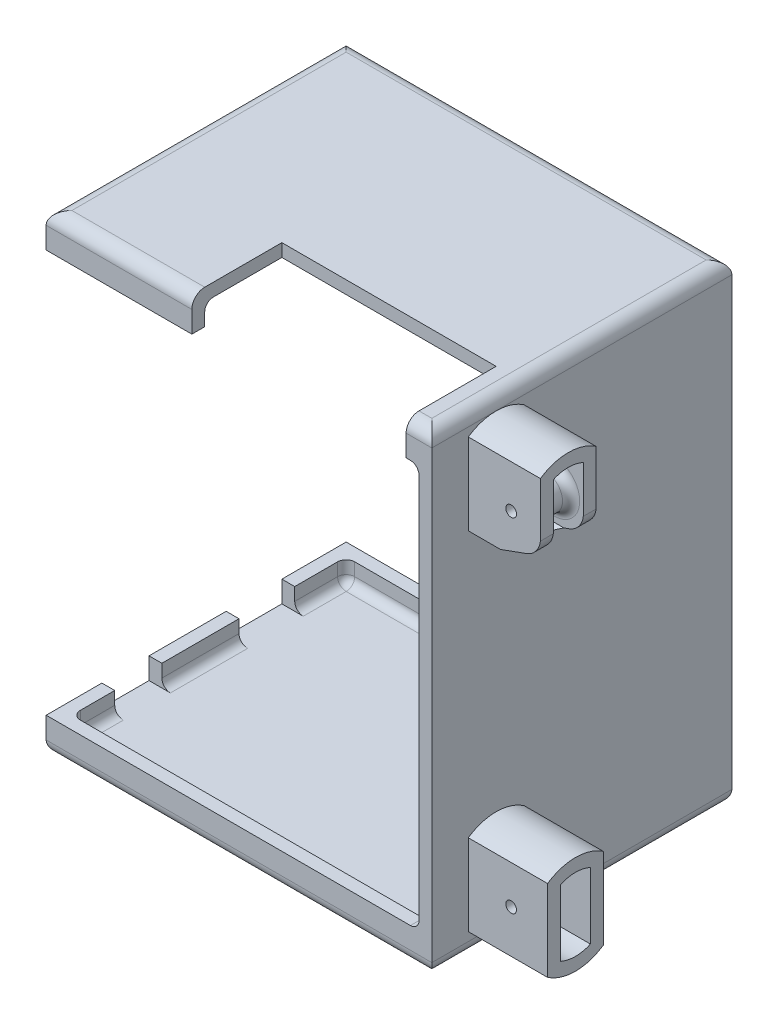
ISO-10303-21;
HEADER;
FILE_DESCRIPTION(('STEP AP214'),'2;1');
FILE_NAME('part.step','',(''),(''),'','','');
FILE_SCHEMA(('AUTOMOTIVE_DESIGN { 1 0 10303 214 1 1 1 1 }'));
ENDSEC;
DATA;
#1=APPLICATION_CONTEXT('core data for automotive mechanical design processes');
#2=APPLICATION_PROTOCOL_DEFINITION('international standard','automotive_design',2000,#1);
#3=PRODUCT_CONTEXT('',#1,'mechanical');
#4=PRODUCT('Part','Part','',(#3));
#5=PRODUCT_RELATED_PRODUCT_CATEGORY('part','',(#4));
#6=PRODUCT_DEFINITION_FORMATION('','',#4);
#7=PRODUCT_DEFINITION_CONTEXT('part definition',#1,'design');
#8=PRODUCT_DEFINITION('design','',#6,#7);
#9=PRODUCT_DEFINITION_SHAPE('','',#8);
#10=(LENGTH_UNIT() NAMED_UNIT(*) SI_UNIT(.MILLI.,.METRE.));
#11=(NAMED_UNIT(*) PLANE_ANGLE_UNIT() SI_UNIT($,.RADIAN.));
#12=(NAMED_UNIT(*) SI_UNIT($,.STERADIAN.) SOLID_ANGLE_UNIT());
#13=UNCERTAINTY_MEASURE_WITH_UNIT(LENGTH_MEASURE(1.E-05),#10,'distance_accuracy_value','');
#14=(GEOMETRIC_REPRESENTATION_CONTEXT(3) GLOBAL_UNCERTAINTY_ASSIGNED_CONTEXT((#13)) GLOBAL_UNIT_ASSIGNED_CONTEXT((#10,
#11,#12)) REPRESENTATION_CONTEXT('',''));
#15=CARTESIAN_POINT('',(0.,0.,0.));
#16=DIRECTION('',(0.,0.,1.));
#17=DIRECTION('',(1.,0.,0.));
#18=AXIS2_PLACEMENT_3D('',#15,#16,#17);
#19=CARTESIAN_POINT('',(-87.,3.,70.));
#20=DIRECTION('',(-1.,0.,0.));
#21=DIRECTION('',(0.,0.,1.));
#22=AXIS2_PLACEMENT_3D('',#19,#20,#21);
#23=PLANE('',#22);
#24=DIRECTION('',(0.,-1.,0.));
#25=VECTOR('',#24,1.);
#26=CARTESIAN_POINT('',(-87.,20.,28.));
#27=LINE('',#26,#25);
#28=CARTESIAN_POINT('',(-87.,8.00000000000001,28.));
#29=VERTEX_POINT('',#28);
#30=CARTESIAN_POINT('',(-87.,5.,28.));
#31=VERTEX_POINT('',#30);
#32=EDGE_CURVE('E1089',#29,#31,#27,.T.);
#33=ORIENTED_EDGE('',*,*,#32,.F.);
#34=DIRECTION('',(0.,0.,1.));
#35=VECTOR('',#34,1.);
#36=CARTESIAN_POINT('',(-87.,8.,70.));
#37=LINE('',#36,#35);
#38=CARTESIAN_POINT('',(-87.,8.00000000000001,46.));
#39=VERTEX_POINT('',#38);
#40=EDGE_CURVE('E1207',#29,#39,#37,.T.);
#41=ORIENTED_EDGE('',*,*,#40,.T.);
#42=DIRECTION('',(0.,1.,0.));
#43=VECTOR('',#42,1.);
#44=CARTESIAN_POINT('',(-87.,20.,46.));
#45=LINE('',#44,#43);
#46=CARTESIAN_POINT('',(-87.,5.,46.));
#47=VERTEX_POINT('',#46);
#48=EDGE_CURVE('E1113',#47,#39,#45,.T.);
#49=ORIENTED_EDGE('',*,*,#48,.F.);
#50=DIRECTION('',(0.,0.,-1.));
#51=VECTOR('',#50,1.);
#52=CARTESIAN_POINT('',(-87.,5.,28.));
#53=LINE('',#52,#51);
#54=EDGE_CURVE('E711',#47,#31,#53,.T.);
#55=ORIENTED_EDGE('',*,*,#54,.T.);
#56=EDGE_LOOP('',(#33,#41,#49,#55));
#57=FACE_BOUND('',#56,.T.);
#58=ADVANCED_FACE('F34',(#57),#23,.F.);
#59=CARTESIAN_POINT('',(-90.,0.,70.));
#60=DIRECTION('',(-1.,0.,0.));
#61=DIRECTION('',(0.,0.,1.));
#62=AXIS2_PLACEMENT_3D('',#59,#60,#61);
#63=PLANE('',#62);
#64=DIRECTION('',(0.,0.,1.));
#65=VECTOR('',#64,1.);
#66=CARTESIAN_POINT('',(-90.,8.00000000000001,0.));
#67=LINE('',#66,#65);
#68=CARTESIAN_POINT('',(-90.,8.00000000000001,28.));
#69=VERTEX_POINT('',#68);
#70=CARTESIAN_POINT('',(-90.,8.,46.));
#71=VERTEX_POINT('',#70);
#72=EDGE_CURVE('E49',#69,#71,#67,.T.);
#73=ORIENTED_EDGE('',*,*,#72,.F.);
#74=DIRECTION('',(0.,1.,0.));
#75=VECTOR('',#74,1.);
#76=CARTESIAN_POINT('',(-90.,20.,28.));
#77=LINE('',#76,#75);
#78=CARTESIAN_POINT('',(-90.,3.,28.));
#79=VERTEX_POINT('',#78);
#80=EDGE_CURVE('E1100',#79,#69,#77,.T.);
#81=ORIENTED_EDGE('',*,*,#80,.F.);
#82=DIRECTION('',(0.,0.,-1.));
#83=VECTOR('',#82,1.);
#84=CARTESIAN_POINT('',(-90.,3.,70.));
#85=LINE('',#84,#83);
#86=CARTESIAN_POINT('',(-90.,3.,46.));
#87=VERTEX_POINT('',#86);
#88=EDGE_CURVE('E539',#79,#87,#85,.F.);
#89=ORIENTED_EDGE('',*,*,#88,.T.);
#90=DIRECTION('',(0.,-1.,0.));
#91=VECTOR('',#90,1.);
#92=CARTESIAN_POINT('',(-90.,20.,46.));
#93=LINE('',#92,#91);
#94=EDGE_CURVE('E1110',#71,#87,#93,.T.);
#95=ORIENTED_EDGE('',*,*,#94,.F.);
#96=EDGE_LOOP('',(#73,#81,#89,#95));
#97=FACE_BOUND('',#96,.T.);
#98=ADVANCED_FACE('F1275',(#97),#63,.T.);
#99=DIRECTION('',(0.,1.,0.));
#100=VECTOR('',#99,1.);
#101=CARTESIAN_POINT('',(-87.,7.99999999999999,5.));
#102=LINE('',#101,#100);
#103=CARTESIAN_POINT('',(-87.,5.,5.));
#104=VERTEX_POINT('',#103);
#105=CARTESIAN_POINT('',(-87.,8.00000000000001,5.));
#106=VERTEX_POINT('',#105);
#107=EDGE_CURVE('E668',#104,#106,#102,.T.);
#108=ORIENTED_EDGE('',*,*,#107,.T.);
#109=DIRECTION('',(0.,0.,1.));
#110=VECTOR('',#109,1.);
#111=CARTESIAN_POINT('',(-87.,8.,70.));
#112=LINE('',#111,#110);
#113=CARTESIAN_POINT('',(-87.,8.00000000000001,15.));
#114=VERTEX_POINT('',#113);
#115=EDGE_CURVE('E57',#106,#114,#112,.T.);
#116=ORIENTED_EDGE('',*,*,#115,.T.);
#117=DIRECTION('',(0.,1.,0.));
#118=VECTOR('',#117,1.);
#119=CARTESIAN_POINT('',(-87.,20.,15.));
#120=LINE('',#119,#118);
#121=CARTESIAN_POINT('',(-87.,5.,15.));
#122=VERTEX_POINT('',#121);
#123=EDGE_CURVE('E1097',#122,#114,#120,.T.);
#124=ORIENTED_EDGE('',*,*,#123,.F.);
#125=DIRECTION('',(0.,0.,-1.));
#126=VECTOR('',#125,1.);
#127=CARTESIAN_POINT('',(-87.,5.,3.));
#128=LINE('',#127,#126);
#129=EDGE_CURVE('E666',#122,#104,#128,.T.);
#130=ORIENTED_EDGE('',*,*,#129,.T.);
#131=EDGE_LOOP('',(#108,#116,#124,#130));
#132=FACE_BOUND('',#131,.T.);
#133=ADVANCED_FACE('F1425',(#132),#23,.F.);
#134=CARTESIAN_POINT('',(-90.,8.00000000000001,0.));
#135=VERTEX_POINT('',#134);
#136=CARTESIAN_POINT('',(-90.,8.00000000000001,15.));
#137=VERTEX_POINT('',#136);
#138=EDGE_CURVE('E489',#135,#137,#67,.T.);
#139=ORIENTED_EDGE('',*,*,#138,.F.);
#140=DIRECTION('',(0.,1.,0.));
#141=VECTOR('',#140,1.);
#142=CARTESIAN_POINT('',(-90.,0.,0.));
#143=LINE('',#142,#141);
#144=CARTESIAN_POINT('',(-90.,3.,0.));
#145=VERTEX_POINT('',#144);
#146=EDGE_CURVE('E504',#145,#135,#143,.T.);
#147=ORIENTED_EDGE('',*,*,#146,.F.);
#148=CARTESIAN_POINT('',(-90.,3.,15.));
#149=VERTEX_POINT('',#148);
#150=EDGE_CURVE('E536',#145,#149,#85,.F.);
#151=ORIENTED_EDGE('',*,*,#150,.T.);
#152=DIRECTION('',(0.,-1.,0.));
#153=VECTOR('',#152,1.);
#154=CARTESIAN_POINT('',(-90.,20.,15.));
#155=LINE('',#154,#153);
#156=EDGE_CURVE('E506',#137,#149,#155,.T.);
#157=ORIENTED_EDGE('',*,*,#156,.F.);
#158=EDGE_LOOP('',(#139,#147,#151,#157));
#159=FACE_BOUND('',#158,.T.);
#160=ADVANCED_FACE('F502',(#159),#63,.T.);
#161=CARTESIAN_POINT('',(0.,0.,70.));
#162=DIRECTION('',(0.,0.,1.));
#163=DIRECTION('',(1.,0.,0.));
#164=AXIS2_PLACEMENT_3D('',#161,#162,#163);
#165=PLANE('',#164);
#166=DIRECTION('',(0.,1.,0.));
#167=VECTOR('',#166,1.);
#168=CARTESIAN_POINT('',(-90.,90.,70.));
#169=LINE('',#168,#167);
#170=CARTESIAN_POINT('',(-90.,102.,70.));
#171=VERTEX_POINT('',#170);
#172=CARTESIAN_POINT('',(-90.,107.,70.));
#173=VERTEX_POINT('',#172);
#174=EDGE_CURVE('E518',#171,#173,#169,.T.);
#175=ORIENTED_EDGE('',*,*,#174,.F.);
#176=DIRECTION('',(1.,0.,0.));
#177=VECTOR('',#176,1.);
#178=CARTESIAN_POINT('',(-500000.,102.,70.));
#179=LINE('',#178,#177);
#180=CARTESIAN_POINT('',(-55.9999999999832,102.,70.));
#181=VERTEX_POINT('',#180);
#182=EDGE_CURVE('E854',#171,#181,#179,.T.);
#183=ORIENTED_EDGE('',*,*,#182,.T.);
#184=DIRECTION('',(0.,-1.,0.));
#185=VECTOR('',#184,1.);
#186=CARTESIAN_POINT('',(-56.,-0.00100000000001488,70.));
#187=LINE('',#186,#185);
#188=CARTESIAN_POINT('',(-56.,107.,70.));
#189=VERTEX_POINT('',#188);
#190=EDGE_CURVE('E887',#189,#181,#187,.T.);
#191=ORIENTED_EDGE('',*,*,#190,.F.);
#192=DIRECTION('',(-1.,0.,0.));
#193=VECTOR('',#192,1.);
#194=CARTESIAN_POINT('',(-90.,107.,70.));
#195=LINE('',#194,#193);
#196=EDGE_CURVE('E561',#189,#173,#195,.T.);
#197=ORIENTED_EDGE('',*,*,#196,.T.);
#198=EDGE_LOOP('',(#175,#183,#191,#197));
#199=FACE_BOUND('',#198,.T.);
#200=ADVANCED_FACE('F885',(#199),#165,.T.);
#201=CARTESIAN_POINT('',(-500000.,107.,67.));
#202=DIRECTION('',(0.,0.,1.));
#203=DIRECTION('',(1.,0.,0.));
#204=AXIS2_PLACEMENT_3D('',#201,#202,#203);
#205=PLANE('',#204);
#206=DIRECTION('',(0.,-1.,0.));
#207=VECTOR('',#206,1.);
#208=CARTESIAN_POINT('',(-85.,107.,67.));
#209=LINE('',#208,#207);
#210=CARTESIAN_POINT('',(-85.,102.,67.));
#211=VERTEX_POINT('',#210);
#212=CARTESIAN_POINT('',(-85.,105.,67.));
#213=VERTEX_POINT('',#212);
#214=EDGE_CURVE('E655',#211,#213,#209,.F.);
#215=ORIENTED_EDGE('',*,*,#214,.T.);
#216=DIRECTION('',(1.,0.,0.));
#217=VECTOR('',#216,1.);
#218=CARTESIAN_POINT('',(-500000.,104.999999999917,67.));
#219=LINE('',#218,#217);
#220=CARTESIAN_POINT('',(-56.,105.,67.));
#221=VERTEX_POINT('',#220);
#222=EDGE_CURVE('E657',#213,#221,#219,.T.);
#223=ORIENTED_EDGE('',*,*,#222,.T.);
#224=DIRECTION('',(0.,-1.,0.));
#225=VECTOR('',#224,1.);
#226=CARTESIAN_POINT('',(-56.,-0.00100000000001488,67.));
#227=LINE('',#226,#225);
#228=CARTESIAN_POINT('',(-55.9999999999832,102.,67.));
#229=VERTEX_POINT('',#228);
#230=EDGE_CURVE('E1082',#221,#229,#227,.T.);
#231=ORIENTED_EDGE('',*,*,#230,.T.);
#232=DIRECTION('',(1.,0.,0.));
#233=VECTOR('',#232,1.);
#234=CARTESIAN_POINT('',(-500000.,102.,67.));
#235=LINE('',#234,#233);
#236=EDGE_CURVE('E851',#211,#229,#235,.T.);
#237=ORIENTED_EDGE('',*,*,#236,.F.);
#238=EDGE_LOOP('',(#215,#223,#231,#237));
#239=FACE_BOUND('',#238,.T.);
#240=ADVANCED_FACE('F1533',(#239),#205,.F.);
#241=CARTESIAN_POINT('',(0.,107.,67.));
#242=DIRECTION('',(1.,0.,0.));
#243=DIRECTION('',(0.,1.,0.));
#244=AXIS2_PLACEMENT_3D('',#241,#242,#243);
#245=CYLINDRICAL_SURFACE('',#244,3.);
#246=ORIENTED_EDGE('',*,*,#196,.F.);
#247=CARTESIAN_POINT('',(-56.,107.,67.));
#248=DIRECTION('',(1.,0.,0.));
#249=DIRECTION('',(0.,0.,-1.));
#250=AXIS2_PLACEMENT_3D('',#247,#248,#249);
#251=CIRCLE('',#250,3.);
#252=CARTESIAN_POINT('',(-56.,110.,67.));
#253=VERTEX_POINT('',#252);
#254=EDGE_CURVE('E892',#253,#189,#251,.T.);
#255=ORIENTED_EDGE('',*,*,#254,.F.);
#256=DIRECTION('',(-1.,0.,0.));
#257=VECTOR('',#256,1.);
#258=CARTESIAN_POINT('',(0.,110.,67.));
#259=LINE('',#258,#257);
#260=CARTESIAN_POINT('',(-87.,110.,67.));
#261=VERTEX_POINT('',#260);
#262=EDGE_CURVE('E543',#261,#253,#259,.F.);
#263=ORIENTED_EDGE('',*,*,#262,.F.);
#264=CARTESIAN_POINT('',(-87.,107.,67.));
#265=DIRECTION('',(0.707106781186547,0.,0.707106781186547));
#266=DIRECTION('',(0.707106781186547,0.,-0.707106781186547));
#267=AXIS2_PLACEMENT_3D('',#264,#265,#266);
#268=ELLIPSE('',#267,4.24264068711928,3.);
#269=EDGE_CURVE('E587',#173,#261,#268,.F.);
#270=ORIENTED_EDGE('',*,*,#269,.F.);
#271=EDGE_LOOP('',(#246,#255,#263,#270));
#272=FACE_BOUND('',#271,.T.);
#273=ADVANCED_FACE('F891',(#272),#245,.T.);
#274=CARTESIAN_POINT('',(0.,0.,70.));
#275=DIRECTION('',(-1.,0.,0.));
#276=DIRECTION('',(0.,0.,1.));
#277=AXIS2_PLACEMENT_3D('',#274,#275,#276);
#278=PLANE('',#277);
#279=DIRECTION('',(0.,-1.,0.));
#280=VECTOR('',#279,1.);
#281=CARTESIAN_POINT('',(0.,5.01316701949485,48.5));
#282=LINE('',#281,#280);
#283=CARTESIAN_POINT('',(0.,23.9868329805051,48.5));
#284=VERTEX_POINT('',#283);
#285=CARTESIAN_POINT('',(0.,5.01316701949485,48.5));
#286=VERTEX_POINT('',#285);
#287=EDGE_CURVE('E1139',#284,#286,#282,.T.);
#288=ORIENTED_EDGE('',*,*,#287,.T.);
#289=CARTESIAN_POINT('',(0.,14.5,55.));
#290=DIRECTION('',(-1.,0.,0.));
#291=DIRECTION('',(0.,0.,-1.));
#292=AXIS2_PLACEMENT_3D('',#289,#290,#291);
#293=CIRCLE('',#292,11.5);
#294=CARTESIAN_POINT('',(0.,3.,55.));
#295=VERTEX_POINT('',#294);
#296=EDGE_CURVE('E1141',#286,#295,#293,.T.);
#297=ORIENTED_EDGE('',*,*,#296,.T.);
#298=DIRECTION('',(0.,0.,-1.));
#299=VECTOR('',#298,1.);
#300=CARTESIAN_POINT('',(0.,3.,0.));
#301=LINE('',#300,#299);
#302=CARTESIAN_POINT('',(0.,3.,0.));
#303=VERTEX_POINT('',#302);
#304=EDGE_CURVE('E557',#295,#303,#301,.T.);
#305=ORIENTED_EDGE('',*,*,#304,.T.);
#306=DIRECTION('',(0.,1.,0.));
#307=VECTOR('',#306,1.);
#308=CARTESIAN_POINT('',(0.,0.,0.));
#309=LINE('',#308,#307);
#310=CARTESIAN_POINT('',(0.,107.,0.));
#311=VERTEX_POINT('',#310);
#312=EDGE_CURVE('E855',#303,#311,#309,.T.);
#313=ORIENTED_EDGE('',*,*,#312,.T.);
#314=DIRECTION('',(0.,0.,-1.));
#315=VECTOR('',#314,1.);
#316=CARTESIAN_POINT('',(0.,107.,70.));
#317=LINE('',#316,#315);
#318=CARTESIAN_POINT('',(0.,107.,55.));
#319=VERTEX_POINT('',#318);
#320=EDGE_CURVE('E554',#311,#319,#317,.F.);
#321=ORIENTED_EDGE('',*,*,#320,.T.);
#322=CARTESIAN_POINT('',(0.,95.5,55.));
#323=DIRECTION('',(1.,0.,0.));
#324=DIRECTION('',(0.,0.,-1.));
#325=AXIS2_PLACEMENT_3D('',#322,#323,#324);
#326=CIRCLE('',#325,11.5);
#327=CARTESIAN_POINT('',(0.,104.986832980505,48.5));
#328=VERTEX_POINT('',#327);
#329=EDGE_CURVE('E911',#328,#319,#326,.T.);
#330=ORIENTED_EDGE('',*,*,#329,.F.);
#331=DIRECTION('',(0.,1.,0.));
#332=VECTOR('',#331,1.);
#333=CARTESIAN_POINT('',(0.,104.986832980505,48.5));
#334=LINE('',#333,#332);
#335=CARTESIAN_POINT('',(0.,86.0131670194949,48.5));
#336=VERTEX_POINT('',#335);
#337=EDGE_CURVE('E931',#336,#328,#334,.T.);
#338=ORIENTED_EDGE('',*,*,#337,.F.);
#339=CARTESIAN_POINT('',(0.,95.5,55.));
#340=DIRECTION('',(1.,0.,0.));
#341=DIRECTION('',(0.,0.,1.));
#342=AXIS2_PLACEMENT_3D('',#339,#340,#341);
#343=CIRCLE('',#342,11.5);
#344=CARTESIAN_POINT('',(0.,86.0131670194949,61.5));
#345=VERTEX_POINT('',#344);
#346=EDGE_CURVE('E923',#345,#336,#343,.T.);
#347=ORIENTED_EDGE('',*,*,#346,.F.);
#348=DIRECTION('',(0.,-1.,0.));
#349=VECTOR('',#348,1.);
#350=CARTESIAN_POINT('',(0.,104.986832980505,61.5));
#351=LINE('',#350,#349);
#352=CARTESIAN_POINT('',(0.,104.986832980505,61.5));
#353=VERTEX_POINT('',#352);
#354=EDGE_CURVE('E920',#353,#345,#351,.T.);
#355=ORIENTED_EDGE('',*,*,#354,.F.);
#356=EDGE_CURVE('E917',#319,#353,#326,.T.);
#357=ORIENTED_EDGE('',*,*,#356,.F.);
#358=CARTESIAN_POINT('',(0.,107.,70.));
#359=VERTEX_POINT('',#358);
#360=EDGE_CURVE('E553',#319,#359,#317,.F.);
#361=ORIENTED_EDGE('',*,*,#360,.T.);
#362=DIRECTION('',(0.,1.,0.));
#363=VECTOR('',#362,1.);
#364=CARTESIAN_POINT('',(0.,0.,70.));
#365=LINE('',#364,#363);
#366=CARTESIAN_POINT('',(0.,3.,70.));
#367=VERTEX_POINT('',#366);
#368=EDGE_CURVE('E514',#367,#359,#365,.T.);
#369=ORIENTED_EDGE('',*,*,#368,.F.);
#370=EDGE_CURVE('E558',#367,#295,#301,.T.);
#371=ORIENTED_EDGE('',*,*,#370,.T.);
#372=CARTESIAN_POINT('',(0.,5.01316701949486,61.5));
#373=VERTEX_POINT('',#372);
#374=EDGE_CURVE('E1144',#295,#373,#293,.T.);
#375=ORIENTED_EDGE('',*,*,#374,.T.);
#376=DIRECTION('',(0.,1.,0.));
#377=VECTOR('',#376,1.);
#378=CARTESIAN_POINT('',(0.,5.01316701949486,61.5));
#379=LINE('',#378,#377);
#380=CARTESIAN_POINT('',(0.,23.9868329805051,61.5));
#381=VERTEX_POINT('',#380);
#382=EDGE_CURVE('E1132',#373,#381,#379,.T.);
#383=ORIENTED_EDGE('',*,*,#382,.T.);
#384=CARTESIAN_POINT('',(0.,14.5,55.));
#385=DIRECTION('',(-1.,0.,0.));
#386=DIRECTION('',(0.,0.,1.));
#387=AXIS2_PLACEMENT_3D('',#384,#385,#386);
#388=CIRCLE('',#387,11.5);
#389=EDGE_CURVE('E1136',#381,#284,#388,.T.);
#390=ORIENTED_EDGE('',*,*,#389,.T.);
#391=EDGE_LOOP('',(#288,#297,#305,#313,#321,#330,#338,#347,#355,#357,#361,#369,#371,#375,#383,#390));
#392=FACE_BOUND('',#391,.T.);
#393=ADVANCED_FACE('F909',(#392),#278,.F.);
#394=CARTESIAN_POINT('',(-3.,3.,70.));
#395=DIRECTION('',(-1.,0.,0.));
#396=DIRECTION('',(0.,0.,1.));
#397=AXIS2_PLACEMENT_3D('',#394,#395,#396);
#398=PLANE('',#397);
#399=CARTESIAN_POINT('',(-3.,95.5,55.));
#400=DIRECTION('',(-1.,0.,0.));
#401=DIRECTION('',(0.,0.,1.));
#402=AXIS2_PLACEMENT_3D('',#399,#400,#401);
#403=CIRCLE('',#402,8.50000000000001);
#404=CARTESIAN_POINT('',(-3.,87.7540333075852,58.5));
#405=VERTEX_POINT('',#404);
#406=CARTESIAN_POINT('',(-3.,87.7540333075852,51.5));
#407=VERTEX_POINT('',#406);
#408=EDGE_CURVE('E985',#405,#407,#403,.F.);
#409=ORIENTED_EDGE('',*,*,#408,.T.);
#410=DIRECTION('',(0.,1.,0.));
#411=VECTOR('',#410,1.);
#412=CARTESIAN_POINT('',(-3.,87.7540333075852,51.5));
#413=LINE('',#412,#411);
#414=CARTESIAN_POINT('',(-3.,103.245966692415,51.5));
#415=VERTEX_POINT('',#414);
#416=EDGE_CURVE('E990',#407,#415,#413,.T.);
#417=ORIENTED_EDGE('',*,*,#416,.T.);
#418=CARTESIAN_POINT('',(-3.,95.5,55.));
#419=DIRECTION('',(-1.,0.,0.));
#420=DIRECTION('',(0.,0.,1.));
#421=AXIS2_PLACEMENT_3D('',#418,#419,#420);
#422=CIRCLE('',#421,8.5);
#423=CARTESIAN_POINT('',(-3.,103.245966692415,58.5));
#424=VERTEX_POINT('',#423);
#425=EDGE_CURVE('E976',#415,#424,#422,.F.);
#426=ORIENTED_EDGE('',*,*,#425,.T.);
#427=DIRECTION('',(0.,-1.,0.));
#428=VECTOR('',#427,1.);
#429=CARTESIAN_POINT('',(-3.,103.245966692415,58.5));
#430=LINE('',#429,#428);
#431=EDGE_CURVE('E981',#424,#405,#430,.T.);
#432=ORIENTED_EDGE('',*,*,#431,.T.);
#433=EDGE_LOOP('',(#409,#417,#426,#432));
#434=FACE_BOUND('',#433,.T.);
#435=DIRECTION('',(0.,1.,0.));
#436=VECTOR('',#435,1.);
#437=CARTESIAN_POINT('',(-3.,2.99999999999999,5.00000000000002));
#438=LINE('',#437,#436);
#439=CARTESIAN_POINT('',(-3.,105.,5.));
#440=VERTEX_POINT('',#439);
#441=CARTESIAN_POINT('',(-3.,100.,5.));
#442=VERTEX_POINT('',#441);
#443=EDGE_CURVE('E629',#440,#442,#438,.F.);
#444=ORIENTED_EDGE('',*,*,#443,.T.);
#445=DIRECTION('',(0.,0.,1.));
#446=VECTOR('',#445,1.);
#447=CARTESIAN_POINT('',(-3.,100.,70.));
#448=LINE('',#447,#446);
#449=CARTESIAN_POINT('',(-3.,100.,0.));
#450=VERTEX_POINT('',#449);
#451=EDGE_CURVE('E633',#442,#450,#448,.F.);
#452=ORIENTED_EDGE('',*,*,#451,.T.);
#453=DIRECTION('',(0.,1.,0.));
#454=VECTOR('',#453,1.);
#455=CARTESIAN_POINT('',(-3.,3.,0.));
#456=LINE('',#455,#454);
#457=CARTESIAN_POINT('',(-3.,9.99999999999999,0.));
#458=VERTEX_POINT('',#457);
#459=EDGE_CURVE('E515',#458,#450,#456,.T.);
#460=ORIENTED_EDGE('',*,*,#459,.F.);
#461=DIRECTION('',(0.,0.,-1.));
#462=VECTOR('',#461,1.);
#463=CARTESIAN_POINT('',(-3.,9.99999999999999,70.));
#464=LINE('',#463,#462);
#465=CARTESIAN_POINT('',(-3.,9.99999999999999,5.));
#466=VERTEX_POINT('',#465);
#467=EDGE_CURVE('E621',#458,#466,#464,.F.);
#468=ORIENTED_EDGE('',*,*,#467,.T.);
#469=DIRECTION('',(0.,1.,0.));
#470=VECTOR('',#469,1.);
#471=CARTESIAN_POINT('',(-3.,3.,5.));
#472=LINE('',#471,#470);
#473=CARTESIAN_POINT('',(-3.,5.,5.));
#474=VERTEX_POINT('',#473);
#475=EDGE_CURVE('E617',#466,#474,#472,.F.);
#476=ORIENTED_EDGE('',*,*,#475,.T.);
#477=DIRECTION('',(0.,0.,-1.));
#478=VECTOR('',#477,1.);
#479=CARTESIAN_POINT('',(-3.,5.,70.));
#480=LINE('',#479,#478);
#481=CARTESIAN_POINT('',(-3.,5.,65.));
#482=VERTEX_POINT('',#481);
#483=EDGE_CURVE('E615',#474,#482,#480,.F.);
#484=ORIENTED_EDGE('',*,*,#483,.T.);
#485=DIRECTION('',(0.,-1.,0.));
#486=VECTOR('',#485,1.);
#487=CARTESIAN_POINT('',(-3.,3.00000000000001,65.));
#488=LINE('',#487,#486);
#489=CARTESIAN_POINT('',(-3.,10.,65.));
#490=VERTEX_POINT('',#489);
#491=EDGE_CURVE('E619',#482,#490,#488,.F.);
#492=ORIENTED_EDGE('',*,*,#491,.T.);
#493=DIRECTION('',(0.,0.,-1.));
#494=VECTOR('',#493,1.);
#495=CARTESIAN_POINT('',(-3.,10.,70.));
#496=LINE('',#495,#494);
#497=CARTESIAN_POINT('',(-3.,10.,70.));
#498=VERTEX_POINT('',#497);
#499=EDGE_CURVE('E623',#490,#498,#496,.F.);
#500=ORIENTED_EDGE('',*,*,#499,.T.);
#501=DIRECTION('',(0.,1.,0.));
#502=VECTOR('',#501,1.);
#503=CARTESIAN_POINT('',(-3.,3.,70.));
#504=LINE('',#503,#502);
#505=CARTESIAN_POINT('',(-3.,100.,70.));
#506=VERTEX_POINT('',#505);
#507=EDGE_CURVE('E858',#498,#506,#504,.T.);
#508=ORIENTED_EDGE('',*,*,#507,.T.);
#509=DIRECTION('',(0.,0.,1.));
#510=VECTOR('',#509,1.);
#511=CARTESIAN_POINT('',(-3.,100.,70.));
#512=LINE('',#511,#510);
#513=CARTESIAN_POINT('',(-3.,100.,65.));
#514=VERTEX_POINT('',#513);
#515=EDGE_CURVE('E631',#506,#514,#512,.F.);
#516=ORIENTED_EDGE('',*,*,#515,.T.);
#517=DIRECTION('',(0.,-1.,0.));
#518=VECTOR('',#517,1.);
#519=CARTESIAN_POINT('',(-3.,3.,65.));
#520=LINE('',#519,#518);
#521=CARTESIAN_POINT('',(-3.,105.,65.));
#522=VERTEX_POINT('',#521);
#523=EDGE_CURVE('E627',#514,#522,#520,.F.);
#524=ORIENTED_EDGE('',*,*,#523,.T.);
#525=DIRECTION('',(0.,0.,-1.));
#526=VECTOR('',#525,1.);
#527=CARTESIAN_POINT('',(-3.,105.,3.));
#528=LINE('',#527,#526);
#529=EDGE_CURVE('E625',#522,#440,#528,.T.);
#530=ORIENTED_EDGE('',*,*,#529,.T.);
#531=EDGE_LOOP('',(#444,#452,#460,#468,#476,#484,#492,#500,#508,#516,#524,#530));
#532=FACE_BOUND('',#531,.T.);
#533=ADVANCED_FACE('F987',(#434,#532),#398,.T.);
#534=CARTESIAN_POINT('',(-3.,3.,70.));
#535=DIRECTION('',(0.,-1.,0.));
#536=DIRECTION('',(0.,0.,-1.));
#537=AXIS2_PLACEMENT_3D('',#534,#535,#536);
#538=PLANE('',#537);
#539=DIRECTION('',(-1.,0.,0.));
#540=VECTOR('',#539,1.);
#541=CARTESIAN_POINT('',(16.8312139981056,3.,57.));
#542=LINE('',#541,#540);
#543=CARTESIAN_POINT('',(-85.,3.,57.));
#544=VERTEX_POINT('',#543);
#545=CARTESIAN_POINT('',(-90.,3.,57.));
#546=VERTEX_POINT('',#545);
#547=EDGE_CURVE('E781',#544,#546,#542,.T.);
#548=ORIENTED_EDGE('',*,*,#547,.F.);
#549=DIRECTION('',(0.,0.,-1.));
#550=VECTOR('',#549,1.);
#551=CARTESIAN_POINT('',(-85.,3.,67.));
#552=LINE('',#551,#550);
#553=CARTESIAN_POINT('',(-85.,3.,65.));
#554=VERTEX_POINT('',#553);
#555=EDGE_CURVE('E709',#544,#554,#552,.F.);
#556=ORIENTED_EDGE('',*,*,#555,.T.);
#557=DIRECTION('',(1.,0.,0.));
#558=VECTOR('',#557,1.);
#559=CARTESIAN_POINT('',(-3.,3.,65.));
#560=LINE('',#559,#558);
#561=CARTESIAN_POINT('',(-5.,3.,65.));
#562=VERTEX_POINT('',#561);
#563=EDGE_CURVE('E707',#554,#562,#560,.T.);
#564=ORIENTED_EDGE('',*,*,#563,.T.);
#565=DIRECTION('',(0.,0.,-1.));
#566=VECTOR('',#565,1.);
#567=CARTESIAN_POINT('',(-5.,3.,70.));
#568=LINE('',#567,#566);
#569=CARTESIAN_POINT('',(-5.,3.,5.));
#570=VERTEX_POINT('',#569);
#571=EDGE_CURVE('E705',#562,#570,#568,.T.);
#572=ORIENTED_EDGE('',*,*,#571,.T.);
#573=DIRECTION('',(1.,0.,0.));
#574=VECTOR('',#573,1.);
#575=CARTESIAN_POINT('',(-86.9999999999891,3.,5.));
#576=LINE('',#575,#574);
#577=CARTESIAN_POINT('',(-85.,3.,5.));
#578=VERTEX_POINT('',#577);
#579=EDGE_CURVE('E703',#570,#578,#576,.F.);
#580=ORIENTED_EDGE('',*,*,#579,.T.);
#581=DIRECTION('',(0.,0.,-1.));
#582=VECTOR('',#581,1.);
#583=CARTESIAN_POINT('',(-85.,3.,15.));
#584=LINE('',#583,#582);
#585=CARTESIAN_POINT('',(-85.,3.,15.));
#586=VERTEX_POINT('',#585);
#587=EDGE_CURVE('E700',#578,#586,#584,.F.);
#588=ORIENTED_EDGE('',*,*,#587,.T.);
#589=DIRECTION('',(-1.,0.,0.));
#590=VECTOR('',#589,1.);
#591=CARTESIAN_POINT('',(16.8312139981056,3.,15.));
#592=LINE('',#591,#590);
#593=EDGE_CURVE('E1090',#586,#149,#592,.T.);
#594=ORIENTED_EDGE('',*,*,#593,.T.);
#595=DIRECTION('',(0.,0.,1.));
#596=VECTOR('',#595,1.);
#597=CARTESIAN_POINT('',(-90.,3.,15.));
#598=LINE('',#597,#596);
#599=EDGE_CURVE('E1102',#149,#79,#598,.T.);
#600=ORIENTED_EDGE('',*,*,#599,.T.);
#601=DIRECTION('',(-1.,0.,0.));
#602=VECTOR('',#601,1.);
#603=CARTESIAN_POINT('',(16.8312139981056,3.,28.));
#604=LINE('',#603,#602);
#605=CARTESIAN_POINT('',(-85.,3.,28.));
#606=VERTEX_POINT('',#605);
#607=EDGE_CURVE('E1093',#606,#79,#604,.T.);
#608=ORIENTED_EDGE('',*,*,#607,.F.);
#609=DIRECTION('',(0.,0.,-1.));
#610=VECTOR('',#609,1.);
#611=CARTESIAN_POINT('',(-85.,3.,46.));
#612=LINE('',#611,#610);
#613=CARTESIAN_POINT('',(-85.,3.,46.));
#614=VERTEX_POINT('',#613);
#615=EDGE_CURVE('E697',#606,#614,#612,.F.);
#616=ORIENTED_EDGE('',*,*,#615,.T.);
#617=DIRECTION('',(-1.,0.,0.));
#618=VECTOR('',#617,1.);
#619=CARTESIAN_POINT('',(16.8312139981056,3.,46.));
#620=LINE('',#619,#618);
#621=EDGE_CURVE('E1107',#614,#87,#620,.T.);
#622=ORIENTED_EDGE('',*,*,#621,.T.);
#623=DIRECTION('',(0.,0.,1.));
#624=VECTOR('',#623,1.);
#625=CARTESIAN_POINT('',(-90.,3.,46.));
#626=LINE('',#625,#624);
#627=EDGE_CURVE('E1118',#87,#546,#626,.T.);
#628=ORIENTED_EDGE('',*,*,#627,.T.);
#629=EDGE_LOOP('',(#548,#556,#564,#572,#580,#588,#594,#600,#608,#616,#622,#628));
#630=FACE_BOUND('',#629,.T.);
#631=ADVANCED_FACE('F1273',(#630),#538,.F.);
#632=DIRECTION('',(0.,-1.,0.));
#633=VECTOR('',#632,1.);
#634=CARTESIAN_POINT('',(-87.,20.,57.));
#635=LINE('',#634,#633);
#636=CARTESIAN_POINT('',(-87.,8.,57.));
#637=VERTEX_POINT('',#636);
#638=CARTESIAN_POINT('',(-87.,5.,57.));
#639=VERTEX_POINT('',#638);
#640=EDGE_CURVE('E1095',#637,#639,#635,.T.);
#641=ORIENTED_EDGE('',*,*,#640,.F.);
#642=DIRECTION('',(0.,0.,1.));
#643=VECTOR('',#642,1.);
#644=CARTESIAN_POINT('',(-87.,8.,70.));
#645=LINE('',#644,#643);
#646=CARTESIAN_POINT('',(-87.,8.,65.));
#647=VERTEX_POINT('',#646);
#648=EDGE_CURVE('E1220',#637,#647,#645,.T.);
#649=ORIENTED_EDGE('',*,*,#648,.T.);
#650=DIRECTION('',(0.,-1.,0.));
#651=VECTOR('',#650,1.);
#652=CARTESIAN_POINT('',(-87.,3.00000000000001,65.));
#653=LINE('',#652,#651);
#654=CARTESIAN_POINT('',(-87.,5.,65.));
#655=VERTEX_POINT('',#654);
#656=EDGE_CURVE('E674',#647,#655,#653,.T.);
#657=ORIENTED_EDGE('',*,*,#656,.T.);
#658=DIRECTION('',(0.,0.,-1.));
#659=VECTOR('',#658,1.);
#660=CARTESIAN_POINT('',(-87.,5.,57.));
#661=LINE('',#660,#659);
#662=EDGE_CURVE('E671',#655,#639,#661,.T.);
#663=ORIENTED_EDGE('',*,*,#662,.T.);
#664=EDGE_LOOP('',(#641,#649,#657,#663));
#665=FACE_BOUND('',#664,.T.);
#666=ADVANCED_FACE('F1426',(#665),#23,.F.);
#667=CARTESIAN_POINT('',(-87.,90.,70.));
#668=DIRECTION('',(-1.,0.,0.));
#669=DIRECTION('',(0.,0.,1.));
#670=AXIS2_PLACEMENT_3D('',#667,#668,#669);
#671=PLANE('',#670);
#672=DIRECTION('',(0.,-1.,0.));
#673=VECTOR('',#672,1.);
#674=CARTESIAN_POINT('',(-87.,102.,65.));
#675=LINE('',#674,#673);
#676=CARTESIAN_POINT('',(-87.,105.,65.));
#677=VERTEX_POINT('',#676);
#678=CARTESIAN_POINT('',(-87.,102.,65.));
#679=VERTEX_POINT('',#678);
#680=EDGE_CURVE('E663',#677,#679,#675,.T.);
#681=ORIENTED_EDGE('',*,*,#680,.T.);
#682=DIRECTION('',(0.,0.,-1.));
#683=VECTOR('',#682,1.);
#684=CARTESIAN_POINT('',(-87.,102.,70.));
#685=LINE('',#684,#683);
#686=CARTESIAN_POINT('',(-87.,102.,5.));
#687=VERTEX_POINT('',#686);
#688=EDGE_CURVE('E1201',#679,#687,#685,.T.);
#689=ORIENTED_EDGE('',*,*,#688,.T.);
#690=DIRECTION('',(0.,1.,0.));
#691=VECTOR('',#690,1.);
#692=CARTESIAN_POINT('',(-87.,107.,5.));
#693=LINE('',#692,#691);
#694=CARTESIAN_POINT('',(-87.,105.,5.));
#695=VERTEX_POINT('',#694);
#696=EDGE_CURVE('E661',#687,#695,#693,.T.);
#697=ORIENTED_EDGE('',*,*,#696,.T.);
#698=DIRECTION('',(0.,0.,-1.));
#699=VECTOR('',#698,1.);
#700=CARTESIAN_POINT('',(-87.,105.,70.));
#701=LINE('',#700,#699);
#702=EDGE_CURVE('E659',#695,#677,#701,.F.);
#703=ORIENTED_EDGE('',*,*,#702,.T.);
#704=EDGE_LOOP('',(#681,#689,#697,#703));
#705=FACE_BOUND('',#704,.T.);
#706=ADVANCED_FACE('F1435',(#705),#671,.F.);
#707=CARTESIAN_POINT('',(-3.,107.,70.));
#708=DIRECTION('',(0.,-1.,0.));
#709=DIRECTION('',(1.,0.,0.));
#710=AXIS2_PLACEMENT_3D('',#707,#708,#709);
#711=PLANE('',#710);
#712=DIRECTION('',(0.,0.,-1.));
#713=VECTOR('',#712,1.);
#714=CARTESIAN_POINT('',(-5.,107.,67.));
#715=LINE('',#714,#713);
#716=CARTESIAN_POINT('',(-5.,107.,5.));
#717=VERTEX_POINT('',#716);
#718=CARTESIAN_POINT('',(-5.,107.,65.));
#719=VERTEX_POINT('',#718);
#720=EDGE_CURVE('E645',#717,#719,#715,.F.);
#721=ORIENTED_EDGE('',*,*,#720,.T.);
#722=DIRECTION('',(1.,0.,0.));
#723=VECTOR('',#722,1.);
#724=CARTESIAN_POINT('',(-3.,107.,65.));
#725=LINE('',#724,#723);
#726=CARTESIAN_POINT('',(-6.,107.,65.));
#727=VERTEX_POINT('',#726);
#728=EDGE_CURVE('E653',#719,#727,#725,.F.);
#729=ORIENTED_EDGE('',*,*,#728,.T.);
#730=DIRECTION('',(0.,0.,-1.));
#731=VECTOR('',#730,1.);
#732=CARTESIAN_POINT('',(-6.,107.,74.2009559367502));
#733=LINE('',#732,#731);
#734=CARTESIAN_POINT('',(-6.,107.,49.));
#735=VERTEX_POINT('',#734);
#736=EDGE_CURVE('E1052',#727,#735,#733,.T.);
#737=ORIENTED_EDGE('',*,*,#736,.T.);
#738=DIRECTION('',(-1.,0.,0.));
#739=VECTOR('',#738,1.);
#740=CARTESIAN_POINT('',(-6.,107.,49.));
#741=LINE('',#740,#739);
#742=CARTESIAN_POINT('',(-56.,107.,49.));
#743=VERTEX_POINT('',#742);
#744=EDGE_CURVE('E1075',#735,#743,#741,.T.);
#745=ORIENTED_EDGE('',*,*,#744,.T.);
#746=DIRECTION('',(0.,0.,-1.));
#747=VECTOR('',#746,1.);
#748=CARTESIAN_POINT('',(-56.,107.,74.2009559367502));
#749=LINE('',#748,#747);
#750=CARTESIAN_POINT('',(-56.,107.,65.));
#751=VERTEX_POINT('',#750);
#752=EDGE_CURVE('E1073',#751,#743,#749,.T.);
#753=ORIENTED_EDGE('',*,*,#752,.F.);
#754=DIRECTION('',(1.,0.,0.));
#755=VECTOR('',#754,1.);
#756=CARTESIAN_POINT('',(-3.,107.,65.));
#757=LINE('',#756,#755);
#758=CARTESIAN_POINT('',(-85.,107.,65.));
#759=VERTEX_POINT('',#758);
#760=EDGE_CURVE('E651',#751,#759,#757,.F.);
#761=ORIENTED_EDGE('',*,*,#760,.T.);
#762=DIRECTION('',(0.,0.,-1.));
#763=VECTOR('',#762,1.);
#764=CARTESIAN_POINT('',(-85.,107.,70.));
#765=LINE('',#764,#763);
#766=CARTESIAN_POINT('',(-85.,107.,5.));
#767=VERTEX_POINT('',#766);
#768=EDGE_CURVE('E649',#759,#767,#765,.T.);
#769=ORIENTED_EDGE('',*,*,#768,.T.);
#770=DIRECTION('',(1.,0.,0.));
#771=VECTOR('',#770,1.);
#772=CARTESIAN_POINT('',(-3.,107.,5.));
#773=LINE('',#772,#771);
#774=EDGE_CURVE('E647',#767,#717,#773,.T.);
#775=ORIENTED_EDGE('',*,*,#774,.T.);
#776=EDGE_LOOP('',(#721,#729,#737,#745,#753,#761,#769,#775));
#777=FACE_BOUND('',#776,.T.);
#778=ADVANCED_FACE('F1371',(#777),#711,.T.);
#779=CARTESIAN_POINT('',(0.,110.,70.));
#780=DIRECTION('',(0.,-1.,0.));
#781=DIRECTION('',(1.,0.,0.));
#782=AXIS2_PLACEMENT_3D('',#779,#780,#781);
#783=PLANE('',#782);
#784=DIRECTION('',(-1.,0.,0.));
#785=VECTOR('',#784,1.);
#786=CARTESIAN_POINT('',(-6.,110.,49.));
#787=LINE('',#786,#785);
#788=CARTESIAN_POINT('',(-6.,110.,49.));
#789=VERTEX_POINT('',#788);
#790=CARTESIAN_POINT('',(-56.,110.,49.));
#791=VERTEX_POINT('',#790);
#792=EDGE_CURVE('E1068',#789,#791,#787,.T.);
#793=ORIENTED_EDGE('',*,*,#792,.F.);
#794=DIRECTION('',(0.,0.,-1.));
#795=VECTOR('',#794,1.);
#796=CARTESIAN_POINT('',(-6.00000000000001,110.,74.2009559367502));
#797=LINE('',#796,#795);
#798=CARTESIAN_POINT('',(-6.00000000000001,110.,67.));
#799=VERTEX_POINT('',#798);
#800=EDGE_CURVE('E1065',#799,#789,#797,.T.);
#801=ORIENTED_EDGE('',*,*,#800,.F.);
#802=CARTESIAN_POINT('',(-3.,110.,67.));
#803=VERTEX_POINT('',#802);
#804=EDGE_CURVE('E542',#799,#803,#259,.F.);
#805=ORIENTED_EDGE('',*,*,#804,.T.);
#806=DIRECTION('',(0.,0.,-1.));
#807=VECTOR('',#806,1.);
#808=CARTESIAN_POINT('',(-3.,110.,70.));
#809=LINE('',#808,#807);
#810=CARTESIAN_POINT('',(-3.,110.,3.));
#811=VERTEX_POINT('',#810);
#812=EDGE_CURVE('E546',#803,#811,#809,.T.);
#813=ORIENTED_EDGE('',*,*,#812,.T.);
#814=DIRECTION('',(-1.,0.,0.));
#815=VECTOR('',#814,1.);
#816=CARTESIAN_POINT('',(0.,110.,3.));
#817=LINE('',#816,#815);
#818=CARTESIAN_POINT('',(-87.,110.,3.));
#819=VERTEX_POINT('',#818);
#820=EDGE_CURVE('E551',#811,#819,#817,.T.);
#821=ORIENTED_EDGE('',*,*,#820,.T.);
#822=DIRECTION('',(0.,0.,-1.));
#823=VECTOR('',#822,1.);
#824=CARTESIAN_POINT('',(-87.,110.,70.));
#825=LINE('',#824,#823);
#826=EDGE_CURVE('E548',#819,#261,#825,.F.);
#827=ORIENTED_EDGE('',*,*,#826,.T.);
#828=ORIENTED_EDGE('',*,*,#262,.T.);
#829=DIRECTION('',(0.,0.,-1.));
#830=VECTOR('',#829,1.);
#831=CARTESIAN_POINT('',(-56.,110.,74.2009559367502));
#832=LINE('',#831,#830);
#833=EDGE_CURVE('E1071',#253,#791,#832,.T.);
#834=ORIENTED_EDGE('',*,*,#833,.T.);
#835=EDGE_LOOP('',(#793,#801,#805,#813,#821,#827,#828,#834));
#836=FACE_BOUND('',#835,.T.);
#837=ADVANCED_FACE('F896',(#836),#783,.F.);
#838=CARTESIAN_POINT('',(-90.,90.,70.));
#839=DIRECTION('',(-1.,0.,0.));
#840=DIRECTION('',(0.,0.,1.));
#841=AXIS2_PLACEMENT_3D('',#838,#839,#840);
#842=PLANE('',#841);
#843=DIRECTION('',(0.,0.,-1.));
#844=VECTOR('',#843,1.);
#845=CARTESIAN_POINT('',(-90.,102.,0.));
#846=LINE('',#845,#844);
#847=CARTESIAN_POINT('',(-90.,102.,0.));
#848=VERTEX_POINT('',#847);
#849=EDGE_CURVE('E507',#171,#848,#846,.T.);
#850=ORIENTED_EDGE('',*,*,#849,.F.);
#851=ORIENTED_EDGE('',*,*,#174,.T.);
#852=DIRECTION('',(0.,0.,-1.));
#853=VECTOR('',#852,1.);
#854=CARTESIAN_POINT('',(-90.,107.,0.));
#855=LINE('',#854,#853);
#856=CARTESIAN_POINT('',(-90.,107.,0.));
#857=VERTEX_POINT('',#856);
#858=EDGE_CURVE('E538',#173,#857,#855,.T.);
#859=ORIENTED_EDGE('',*,*,#858,.T.);
#860=DIRECTION('',(0.,1.,0.));
#861=VECTOR('',#860,1.);
#862=CARTESIAN_POINT('',(-90.,90.,0.));
#863=LINE('',#862,#861);
#864=EDGE_CURVE('E521',#848,#857,#863,.T.);
#865=ORIENTED_EDGE('',*,*,#864,.F.);
#866=EDGE_LOOP('',(#850,#851,#859,#865));
#867=FACE_BOUND('',#866,.T.);
#868=ADVANCED_FACE('F878',(#867),#842,.T.);
#869=CARTESIAN_POINT('',(-90.,8.,57.));
#870=VERTEX_POINT('',#869);
#871=CARTESIAN_POINT('',(-90.,8.,70.));
#872=VERTEX_POINT('',#871);
#873=EDGE_CURVE('E509',#870,#872,#67,.T.);
#874=ORIENTED_EDGE('',*,*,#873,.F.);
#875=DIRECTION('',(0.,1.,0.));
#876=VECTOR('',#875,1.);
#877=CARTESIAN_POINT('',(-90.,20.,57.));
#878=LINE('',#877,#876);
#879=EDGE_CURVE('E1116',#546,#870,#878,.T.);
#880=ORIENTED_EDGE('',*,*,#879,.F.);
#881=CARTESIAN_POINT('',(-90.,3.,70.));
#882=VERTEX_POINT('',#881);
#883=EDGE_CURVE('E535',#546,#882,#85,.F.);
#884=ORIENTED_EDGE('',*,*,#883,.T.);
#885=DIRECTION('',(0.,1.,0.));
#886=VECTOR('',#885,1.);
#887=CARTESIAN_POINT('',(-90.,0.,70.));
#888=LINE('',#887,#886);
#889=EDGE_CURVE('E528',#882,#872,#888,.T.);
#890=ORIENTED_EDGE('',*,*,#889,.T.);
#891=EDGE_LOOP('',(#874,#880,#884,#890));
#892=FACE_BOUND('',#891,.T.);
#893=ADVANCED_FACE('F1290',(#892),#63,.T.);
#894=CARTESIAN_POINT('',(0.,0.,70.));
#895=DIRECTION('',(0.,-1.,0.));
#896=DIRECTION('',(0.,0.,-1.));
#897=AXIS2_PLACEMENT_3D('',#894,#895,#896);
#898=PLANE('',#897);
#899=DIRECTION('',(0.,0.,-1.));
#900=VECTOR('',#899,1.);
#901=CARTESIAN_POINT('',(-3.,0.,70.));
#902=LINE('',#901,#900);
#903=CARTESIAN_POINT('',(-3.,0.,3.));
#904=VERTEX_POINT('',#903);
#905=CARTESIAN_POINT('',(-3.,0.,67.));
#906=VERTEX_POINT('',#905);
#907=EDGE_CURVE('E527',#904,#906,#902,.F.);
#908=ORIENTED_EDGE('',*,*,#907,.T.);
#909=DIRECTION('',(-1.,0.,0.));
#910=VECTOR('',#909,1.);
#911=CARTESIAN_POINT('',(0.,0.,67.));
#912=LINE('',#911,#910);
#913=CARTESIAN_POINT('',(-87.,0.,67.));
#914=VERTEX_POINT('',#913);
#915=EDGE_CURVE('E533',#906,#914,#912,.T.);
#916=ORIENTED_EDGE('',*,*,#915,.T.);
#917=DIRECTION('',(0.,0.,-1.));
#918=VECTOR('',#917,1.);
#919=CARTESIAN_POINT('',(-87.,0.,70.));
#920=LINE('',#919,#918);
#921=CARTESIAN_POINT('',(-87.,0.,3.));
#922=VERTEX_POINT('',#921);
#923=EDGE_CURVE('E530',#914,#922,#920,.T.);
#924=ORIENTED_EDGE('',*,*,#923,.T.);
#925=DIRECTION('',(-1.,0.,0.));
#926=VECTOR('',#925,1.);
#927=CARTESIAN_POINT('',(0.,0.,3.));
#928=LINE('',#927,#926);
#929=EDGE_CURVE('E525',#922,#904,#928,.F.);
#930=ORIENTED_EDGE('',*,*,#929,.T.);
#931=EDGE_LOOP('',(#908,#916,#924,#930));
#932=FACE_BOUND('',#931,.T.);
#933=ADVANCED_FACE('F1260',(#932),#898,.T.);
#934=DIRECTION('',(1.,0.,0.));
#935=VECTOR('',#934,1.);
#936=CARTESIAN_POINT('',(-500000.,8.,70.));
#937=LINE('',#936,#935);
#938=CARTESIAN_POINT('',(-4.99999999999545,8.,70.));
#939=VERTEX_POINT('',#938);
#940=EDGE_CURVE('E583',#872,#939,#937,.T.);
#941=ORIENTED_EDGE('',*,*,#940,.F.);
#942=ORIENTED_EDGE('',*,*,#889,.F.);
#943=DIRECTION('',(-1.,0.,0.));
#944=VECTOR('',#943,1.);
#945=CARTESIAN_POINT('',(0.,3.,70.));
#946=LINE('',#945,#944);
#947=EDGE_CURVE('E565',#882,#367,#946,.F.);
#948=ORIENTED_EDGE('',*,*,#947,.T.);
#949=ORIENTED_EDGE('',*,*,#368,.T.);
#950=CARTESIAN_POINT('',(-6.00000000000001,107.,70.));
#951=VERTEX_POINT('',#950);
#952=EDGE_CURVE('E562',#359,#951,#195,.T.);
#953=ORIENTED_EDGE('',*,*,#952,.T.);
#954=DIRECTION('',(0.,-1.,0.));
#955=VECTOR('',#954,1.);
#956=CARTESIAN_POINT('',(-5.99999999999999,-0.001000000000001,70.));
#957=LINE('',#956,#955);
#958=CARTESIAN_POINT('',(-5.99999999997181,102.,70.));
#959=VERTEX_POINT('',#958);
#960=EDGE_CURVE('E1058',#951,#959,#957,.T.);
#961=ORIENTED_EDGE('',*,*,#960,.T.);
#962=CARTESIAN_POINT('',(-4.99999999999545,102.,70.));
#963=VERTEX_POINT('',#962);
#964=EDGE_CURVE('E853',#959,#963,#179,.T.);
#965=ORIENTED_EDGE('',*,*,#964,.T.);
#966=CARTESIAN_POINT('',(-4.99999999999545,100.,70.));
#967=DIRECTION('',(0.,0.,1.));
#968=DIRECTION('',(1.,0.,0.));
#969=AXIS2_PLACEMENT_3D('',#966,#967,#968);
#970=CIRCLE('',#969,2.);
#971=EDGE_CURVE('E717',#963,#506,#970,.F.);
#972=ORIENTED_EDGE('',*,*,#971,.T.);
#973=ORIENTED_EDGE('',*,*,#507,.F.);
#974=CARTESIAN_POINT('',(-4.99999999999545,10.,70.));
#975=DIRECTION('',(0.,0.,1.));
#976=DIRECTION('',(1.,0.,0.));
#977=AXIS2_PLACEMENT_3D('',#974,#975,#976);
#978=CIRCLE('',#977,2.);
#979=EDGE_CURVE('E719',#498,#939,#978,.F.);
#980=ORIENTED_EDGE('',*,*,#979,.T.);
#981=EDGE_LOOP('',(#941,#942,#948,#949,#953,#961,#965,#972,#973,#980));
#982=FACE_BOUND('',#981,.T.);
#983=ADVANCED_FACE('F1240',(#982),#165,.T.);
#984=CARTESIAN_POINT('',(0.,0.,0.));
#985=DIRECTION('',(0.,0.,1.));
#986=DIRECTION('',(1.,0.,0.));
#987=AXIS2_PLACEMENT_3D('',#984,#985,#986);
#988=PLANE('',#987);
#989=DIRECTION('',(1.,0.,0.));
#990=VECTOR('',#989,1.);
#991=CARTESIAN_POINT('',(-500000.,102.,0.));
#992=LINE('',#991,#990);
#993=CARTESIAN_POINT('',(-4.99999999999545,102.,0.));
#994=VERTEX_POINT('',#993);
#995=EDGE_CURVE('E842',#848,#994,#992,.T.);
#996=ORIENTED_EDGE('',*,*,#995,.F.);
#997=ORIENTED_EDGE('',*,*,#864,.T.);
#998=DIRECTION('',(-1.,0.,0.));
#999=VECTOR('',#998,1.);
#1000=CARTESIAN_POINT('',(0.,107.,0.));
#1001=LINE('',#1000,#999);
#1002=EDGE_CURVE('E567',#857,#311,#1001,.F.);
#1003=ORIENTED_EDGE('',*,*,#1002,.T.);
#1004=ORIENTED_EDGE('',*,*,#312,.F.);
#1005=DIRECTION('',(-1.,0.,0.));
#1006=VECTOR('',#1005,1.);
#1007=CARTESIAN_POINT('',(-90.,3.,0.));
#1008=LINE('',#1007,#1006);
#1009=EDGE_CURVE('E513',#303,#145,#1008,.T.);
#1010=ORIENTED_EDGE('',*,*,#1009,.T.);
#1011=ORIENTED_EDGE('',*,*,#146,.T.);
#1012=DIRECTION('',(1.,0.,0.));
#1013=VECTOR('',#1012,1.);
#1014=CARTESIAN_POINT('',(-500000.,7.99999999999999,0.));
#1015=LINE('',#1014,#1013);
#1016=CARTESIAN_POINT('',(-4.99999999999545,7.99999999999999,0.));
#1017=VERTEX_POINT('',#1016);
#1018=EDGE_CURVE('E486',#135,#1017,#1015,.T.);
#1019=ORIENTED_EDGE('',*,*,#1018,.T.);
#1020=CARTESIAN_POINT('',(-4.99999999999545,9.99999999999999,0.));
#1021=DIRECTION('',(0.,0.,1.));
#1022=DIRECTION('',(1.,0.,0.));
#1023=AXIS2_PLACEMENT_3D('',#1020,#1021,#1022);
#1024=CIRCLE('',#1023,2.);
#1025=EDGE_CURVE('E722',#1017,#458,#1024,.T.);
#1026=ORIENTED_EDGE('',*,*,#1025,.T.);
#1027=ORIENTED_EDGE('',*,*,#459,.T.);
#1028=CARTESIAN_POINT('',(-4.99999999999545,100.,0.));
#1029=DIRECTION('',(0.,0.,1.));
#1030=DIRECTION('',(1.,0.,0.));
#1031=AXIS2_PLACEMENT_3D('',#1028,#1029,#1030);
#1032=CIRCLE('',#1031,2.);
#1033=EDGE_CURVE('E714',#450,#994,#1032,.T.);
#1034=ORIENTED_EDGE('',*,*,#1033,.T.);
#1035=EDGE_LOOP('',(#996,#997,#1003,#1004,#1010,#1011,#1019,#1026,#1027,#1034));
#1036=FACE_BOUND('',#1035,.T.);
#1037=ADVANCED_FACE('F510',(#1036),#988,.F.);
#1038=CARTESIAN_POINT('',(-500000.,102.,70.));
#1039=DIRECTION('',(0.,1.,0.));
#1040=DIRECTION('',(0.,0.,1.));
#1041=AXIS2_PLACEMENT_3D('',#1038,#1039,#1040);
#1042=PLANE('',#1041);
#1043=CARTESIAN_POINT('',(-5.99999999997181,102.,67.));
#1044=VERTEX_POINT('',#1043);
#1045=CARTESIAN_POINT('',(-4.99999999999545,102.,67.));
#1046=VERTEX_POINT('',#1045);
#1047=EDGE_CURVE('E850',#1044,#1046,#235,.T.);
#1048=ORIENTED_EDGE('',*,*,#1047,.T.);
#1049=DIRECTION('',(0.,0.,1.));
#1050=VECTOR('',#1049,1.);
#1051=CARTESIAN_POINT('',(-4.99999999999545,102.,70.));
#1052=LINE('',#1051,#1050);
#1053=EDGE_CURVE('E635',#1046,#963,#1052,.T.);
#1054=ORIENTED_EDGE('',*,*,#1053,.T.);
#1055=ORIENTED_EDGE('',*,*,#964,.F.);
#1056=DIRECTION('',(0.,0.,1.));
#1057=VECTOR('',#1056,1.);
#1058=CARTESIAN_POINT('',(-6.,102.,74.2009559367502));
#1059=LINE('',#1058,#1057);
#1060=EDGE_CURVE('E1056',#1044,#959,#1059,.T.);
#1061=ORIENTED_EDGE('',*,*,#1060,.F.);
#1062=EDGE_LOOP('',(#1048,#1054,#1055,#1061));
#1063=FACE_BOUND('',#1062,.T.);
#1064=ADVANCED_FACE('F1396',(#1063),#1042,.F.);
#1065=DIRECTION('',(0.,-1.,0.));
#1066=VECTOR('',#1065,1.);
#1067=CARTESIAN_POINT('',(-5.99999999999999,-0.001000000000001,67.));
#1068=LINE('',#1067,#1066);
#1069=CARTESIAN_POINT('',(-6.,105.,67.));
#1070=VERTEX_POINT('',#1069);
#1071=EDGE_CURVE('E1054',#1070,#1044,#1068,.T.);
#1072=ORIENTED_EDGE('',*,*,#1071,.F.);
#1073=DIRECTION('',(1.,0.,0.));
#1074=VECTOR('',#1073,1.);
#1075=CARTESIAN_POINT('',(-500000.,104.999999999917,67.));
#1076=LINE('',#1075,#1074);
#1077=CARTESIAN_POINT('',(-4.99999999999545,105.,67.));
#1078=VERTEX_POINT('',#1077);
#1079=EDGE_CURVE('E643',#1070,#1078,#1076,.T.);
#1080=ORIENTED_EDGE('',*,*,#1079,.T.);
#1081=DIRECTION('',(0.,-1.,0.));
#1082=VECTOR('',#1081,1.);
#1083=CARTESIAN_POINT('',(-4.99999999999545,107.,67.));
#1084=LINE('',#1083,#1082);
#1085=EDGE_CURVE('E641',#1078,#1046,#1084,.T.);
#1086=ORIENTED_EDGE('',*,*,#1085,.T.);
#1087=ORIENTED_EDGE('',*,*,#1047,.F.);
#1088=EDGE_LOOP('',(#1072,#1080,#1086,#1087));
#1089=FACE_BOUND('',#1088,.T.);
#1090=ADVANCED_FACE('F1391',(#1089),#205,.F.);
#1091=CARTESIAN_POINT('',(-500000.,7.99999999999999,0.));
#1092=DIRECTION('',(0.,-1.,0.));
#1093=DIRECTION('',(0.,0.,-1.));
#1094=AXIS2_PLACEMENT_3D('',#1091,#1092,#1093);
#1095=PLANE('',#1094);
#1096=DIRECTION('',(1.,0.,0.));
#1097=VECTOR('',#1096,1.);
#1098=CARTESIAN_POINT('',(-500000.,7.99999999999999,3.));
#1099=LINE('',#1098,#1097);
#1100=CARTESIAN_POINT('',(-85.,8.00000000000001,3.));
#1101=VERTEX_POINT('',#1100);
#1102=CARTESIAN_POINT('',(-4.99999999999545,7.99999999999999,3.));
#1103=VERTEX_POINT('',#1102);
#1104=EDGE_CURVE('E496',#1101,#1103,#1099,.T.);
#1105=ORIENTED_EDGE('',*,*,#1104,.T.);
#1106=DIRECTION('',(0.,0.,-1.));
#1107=VECTOR('',#1106,1.);
#1108=CARTESIAN_POINT('',(-4.99999999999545,7.99999999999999,0.));
#1109=LINE('',#1108,#1107);
#1110=EDGE_CURVE('E492',#1103,#1017,#1109,.T.);
#1111=ORIENTED_EDGE('',*,*,#1110,.T.);
#1112=ORIENTED_EDGE('',*,*,#1018,.F.);
#1113=ORIENTED_EDGE('',*,*,#138,.T.);
#1114=DIRECTION('',(-1.,0.,0.));
#1115=VECTOR('',#1114,1.);
#1116=CARTESIAN_POINT('',(16.8312139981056,8.00000000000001,15.));
#1117=LINE('',#1116,#1115);
#1118=EDGE_CURVE('E1212',#114,#137,#1117,.T.);
#1119=ORIENTED_EDGE('',*,*,#1118,.F.);
#1120=ORIENTED_EDGE('',*,*,#115,.F.);
#1121=CARTESIAN_POINT('',(-85.,8.00000000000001,5.));
#1122=DIRECTION('',(0.,-1.,0.));
#1123=DIRECTION('',(0.,0.,-1.));
#1124=AXIS2_PLACEMENT_3D('',#1121,#1122,#1123);
#1125=CIRCLE('',#1124,2.);
#1126=EDGE_CURVE('E1215',#1101,#106,#1125,.F.);
#1127=ORIENTED_EDGE('',*,*,#1126,.F.);
#1128=EDGE_LOOP('',(#1105,#1111,#1112,#1113,#1119,#1120,#1127));
#1129=FACE_BOUND('',#1128,.T.);
#1130=ADVANCED_FACE('F488',(#1129),#1095,.F.);
#1131=CARTESIAN_POINT('',(-500000.,3.,3.));
#1132=DIRECTION('',(0.,0.,-1.));
#1133=DIRECTION('',(-1.,0.,0.));
#1134=AXIS2_PLACEMENT_3D('',#1131,#1132,#1133);
#1135=PLANE('',#1134);
#1136=ORIENTED_EDGE('',*,*,#1104,.F.);
#1137=DIRECTION('',(0.,1.,0.));
#1138=VECTOR('',#1137,1.);
#1139=CARTESIAN_POINT('',(-85.,3.,3.));
#1140=LINE('',#1139,#1138);
#1141=CARTESIAN_POINT('',(-85.,5.,3.));
#1142=VERTEX_POINT('',#1141);
#1143=EDGE_CURVE('E688',#1101,#1142,#1140,.F.);
#1144=ORIENTED_EDGE('',*,*,#1143,.T.);
#1145=DIRECTION('',(1.,0.,0.));
#1146=VECTOR('',#1145,1.);
#1147=CARTESIAN_POINT('',(-2.9999999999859,5.,3.));
#1148=LINE('',#1147,#1146);
#1149=CARTESIAN_POINT('',(-4.99999999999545,5.,3.));
#1150=VERTEX_POINT('',#1149);
#1151=EDGE_CURVE('E683',#1142,#1150,#1148,.T.);
#1152=ORIENTED_EDGE('',*,*,#1151,.T.);
#1153=DIRECTION('',(0.,1.,0.));
#1154=VECTOR('',#1153,1.);
#1155=CARTESIAN_POINT('',(-4.99999999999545,3.,3.));
#1156=LINE('',#1155,#1154);
#1157=EDGE_CURVE('E685',#1150,#1103,#1156,.T.);
#1158=ORIENTED_EDGE('',*,*,#1157,.T.);
#1159=EDGE_LOOP('',(#1136,#1144,#1152,#1158));
#1160=FACE_BOUND('',#1159,.T.);
#1161=ADVANCED_FACE('F1335',(#1160),#1135,.F.);
#1162=CARTESIAN_POINT('',(-500000.,107.,3.));
#1163=DIRECTION('',(0.,0.,-1.));
#1164=DIRECTION('',(0.,1.,0.));
#1165=AXIS2_PLACEMENT_3D('',#1162,#1163,#1164);
#1166=PLANE('',#1165);
#1167=DIRECTION('',(1.,0.,0.));
#1168=VECTOR('',#1167,1.);
#1169=CARTESIAN_POINT('',(-500000.,104.999999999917,3.));
#1170=LINE('',#1169,#1168);
#1171=CARTESIAN_POINT('',(-4.99999999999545,105.,3.));
#1172=VERTEX_POINT('',#1171);
#1173=CARTESIAN_POINT('',(-85.,105.,3.));
#1174=VERTEX_POINT('',#1173);
#1175=EDGE_CURVE('E690',#1172,#1174,#1170,.F.);
#1176=ORIENTED_EDGE('',*,*,#1175,.T.);
#1177=DIRECTION('',(0.,1.,0.));
#1178=VECTOR('',#1177,1.);
#1179=CARTESIAN_POINT('',(-85.,102.,3.));
#1180=LINE('',#1179,#1178);
#1181=CARTESIAN_POINT('',(-84.9999999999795,102.,3.));
#1182=VERTEX_POINT('',#1181);
#1183=EDGE_CURVE('E694',#1174,#1182,#1180,.F.);
#1184=ORIENTED_EDGE('',*,*,#1183,.T.);
#1185=DIRECTION('',(1.,0.,0.));
#1186=VECTOR('',#1185,1.);
#1187=CARTESIAN_POINT('',(-500000.,102.,3.));
#1188=LINE('',#1187,#1186);
#1189=CARTESIAN_POINT('',(-4.99999999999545,102.,3.));
#1190=VERTEX_POINT('',#1189);
#1191=EDGE_CURVE('E497',#1182,#1190,#1188,.T.);
#1192=ORIENTED_EDGE('',*,*,#1191,.T.);
#1193=DIRECTION('',(0.,1.,0.));
#1194=VECTOR('',#1193,1.);
#1195=CARTESIAN_POINT('',(-4.99999999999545,107.,3.));
#1196=LINE('',#1195,#1194);
#1197=EDGE_CURVE('E692',#1190,#1172,#1196,.T.);
#1198=ORIENTED_EDGE('',*,*,#1197,.T.);
#1199=EDGE_LOOP('',(#1176,#1184,#1192,#1198));
#1200=FACE_BOUND('',#1199,.T.);
#1201=ADVANCED_FACE('F1355',(#1200),#1166,.F.);
#1202=CARTESIAN_POINT('',(-500000.,102.,0.));
#1203=DIRECTION('',(0.,1.,0.));
#1204=DIRECTION('',(0.,0.,1.));
#1205=AXIS2_PLACEMENT_3D('',#1202,#1203,#1204);
#1206=PLANE('',#1205);
#1207=ORIENTED_EDGE('',*,*,#995,.T.);
#1208=DIRECTION('',(0.,0.,1.));
#1209=VECTOR('',#1208,1.);
#1210=CARTESIAN_POINT('',(-4.99999999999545,102.,0.));
#1211=LINE('',#1210,#1209);
#1212=EDGE_CURVE('E612',#994,#1190,#1211,.T.);
#1213=ORIENTED_EDGE('',*,*,#1212,.T.);
#1214=ORIENTED_EDGE('',*,*,#1191,.F.);
#1215=CARTESIAN_POINT('',(-85.,102.,5.));
#1216=DIRECTION('',(0.,1.,0.));
#1217=DIRECTION('',(0.,0.,1.));
#1218=AXIS2_PLACEMENT_3D('',#1215,#1216,#1217);
#1219=CIRCLE('',#1218,2.);
#1220=EDGE_CURVE('E12',#687,#1182,#1219,.F.);
#1221=ORIENTED_EDGE('',*,*,#1220,.F.);
#1222=ORIENTED_EDGE('',*,*,#688,.F.);
#1223=CARTESIAN_POINT('',(-85.,102.,65.));
#1224=DIRECTION('',(0.,1.,0.));
#1225=DIRECTION('',(0.,0.,1.));
#1226=AXIS2_PLACEMENT_3D('',#1223,#1224,#1225);
#1227=CIRCLE('',#1226,2.);
#1228=EDGE_CURVE('E827',#211,#679,#1227,.F.);
#1229=ORIENTED_EDGE('',*,*,#1228,.F.);
#1230=ORIENTED_EDGE('',*,*,#236,.T.);
#1231=DIRECTION('',(0.,0.,1.));
#1232=VECTOR('',#1231,1.);
#1233=CARTESIAN_POINT('',(-56.,102.,74.2009559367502));
#1234=LINE('',#1233,#1232);
#1235=EDGE_CURVE('E1079',#229,#181,#1234,.T.);
#1236=ORIENTED_EDGE('',*,*,#1235,.T.);
#1237=ORIENTED_EDGE('',*,*,#182,.F.);
#1238=ORIENTED_EDGE('',*,*,#849,.T.);
#1239=EDGE_LOOP('',(#1207,#1213,#1214,#1221,#1222,#1229,#1230,#1236,#1237,#1238));
#1240=FACE_BOUND('',#1239,.T.);
#1241=ADVANCED_FACE('F1223',(#1240),#1206,.F.);
#1242=CARTESIAN_POINT('',(-500000.,3.,67.));
#1243=DIRECTION('',(0.,0.,1.));
#1244=DIRECTION('',(0.,-1.,0.));
#1245=AXIS2_PLACEMENT_3D('',#1242,#1243,#1244);
#1246=PLANE('',#1245);
#1247=DIRECTION('',(1.,0.,0.));
#1248=VECTOR('',#1247,1.);
#1249=CARTESIAN_POINT('',(-86.9999999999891,4.99999999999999,67.));
#1250=LINE('',#1249,#1248);
#1251=CARTESIAN_POINT('',(-4.99999999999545,4.99999999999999,67.));
#1252=VERTEX_POINT('',#1251);
#1253=CARTESIAN_POINT('',(-85.,4.99999999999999,67.));
#1254=VERTEX_POINT('',#1253);
#1255=EDGE_CURVE('E676',#1252,#1254,#1250,.F.);
#1256=ORIENTED_EDGE('',*,*,#1255,.T.);
#1257=DIRECTION('',(0.,-1.,0.));
#1258=VECTOR('',#1257,1.);
#1259=CARTESIAN_POINT('',(-85.,8.,67.));
#1260=LINE('',#1259,#1258);
#1261=CARTESIAN_POINT('',(-84.9999999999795,8.,67.));
#1262=VERTEX_POINT('',#1261);
#1263=EDGE_CURVE('E680',#1254,#1262,#1260,.F.);
#1264=ORIENTED_EDGE('',*,*,#1263,.T.);
#1265=DIRECTION('',(1.,0.,0.));
#1266=VECTOR('',#1265,1.);
#1267=CARTESIAN_POINT('',(-500000.,8.,67.));
#1268=LINE('',#1267,#1266);
#1269=CARTESIAN_POINT('',(-4.99999999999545,8.,67.));
#1270=VERTEX_POINT('',#1269);
#1271=EDGE_CURVE('E838',#1262,#1270,#1268,.T.);
#1272=ORIENTED_EDGE('',*,*,#1271,.T.);
#1273=DIRECTION('',(0.,-1.,0.));
#1274=VECTOR('',#1273,1.);
#1275=CARTESIAN_POINT('',(-4.99999999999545,3.,67.));
#1276=LINE('',#1275,#1274);
#1277=EDGE_CURVE('E678',#1270,#1252,#1276,.T.);
#1278=ORIENTED_EDGE('',*,*,#1277,.T.);
#1279=EDGE_LOOP('',(#1256,#1264,#1272,#1278));
#1280=FACE_BOUND('',#1279,.T.);
#1281=ADVANCED_FACE('F837',(#1280),#1246,.F.);
#1282=CARTESIAN_POINT('',(-500000.,8.,70.));
#1283=DIRECTION('',(0.,-1.,0.));
#1284=DIRECTION('',(0.,0.,-1.));
#1285=AXIS2_PLACEMENT_3D('',#1282,#1283,#1284);
#1286=PLANE('',#1285);
#1287=ORIENTED_EDGE('',*,*,#940,.T.);
#1288=DIRECTION('',(0.,0.,-1.));
#1289=VECTOR('',#1288,1.);
#1290=CARTESIAN_POINT('',(-4.99999999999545,8.,70.));
#1291=LINE('',#1290,#1289);
#1292=EDGE_CURVE('E637',#939,#1270,#1291,.T.);
#1293=ORIENTED_EDGE('',*,*,#1292,.T.);
#1294=ORIENTED_EDGE('',*,*,#1271,.F.);
#1295=CARTESIAN_POINT('',(-85.,8.,65.));
#1296=DIRECTION('',(0.,-1.,0.));
#1297=DIRECTION('',(0.,0.,-1.));
#1298=AXIS2_PLACEMENT_3D('',#1295,#1296,#1297);
#1299=CIRCLE('',#1298,2.);
#1300=EDGE_CURVE('E42',#647,#1262,#1299,.F.);
#1301=ORIENTED_EDGE('',*,*,#1300,.F.);
#1302=ORIENTED_EDGE('',*,*,#648,.F.);
#1303=DIRECTION('',(1.,0.,0.));
#1304=VECTOR('',#1303,1.);
#1305=CARTESIAN_POINT('',(16.8312139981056,8.,57.));
#1306=LINE('',#1305,#1304);
#1307=EDGE_CURVE('E1217',#870,#637,#1306,.T.);
#1308=ORIENTED_EDGE('',*,*,#1307,.F.);
#1309=ORIENTED_EDGE('',*,*,#873,.T.);
#1310=EDGE_LOOP('',(#1287,#1293,#1294,#1301,#1302,#1308,#1309));
#1311=FACE_BOUND('',#1310,.T.);
#1312=ADVANCED_FACE('F840',(#1311),#1286,.F.);
#1313=CARTESIAN_POINT('',(-3.,3.,70.));
#1314=DIRECTION('',(0.,0.,1.));
#1315=DIRECTION('',(1.,0.,0.));
#1316=AXIS2_PLACEMENT_3D('',#1313,#1314,#1315);
#1317=CYLINDRICAL_SURFACE('',#1316,3.);
#1318=CARTESIAN_POINT('',(-3.,3.,3.));
#1319=DIRECTION('',(0.707106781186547,0.,0.707106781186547));
#1320=DIRECTION('',(0.707106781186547,0.,-0.707106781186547));
#1321=AXIS2_PLACEMENT_3D('',#1318,#1319,#1320);
#1322=ELLIPSE('',#1321,4.24264068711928,3.);
#1323=EDGE_CURVE('E577',#303,#904,#1322,.F.);
#1324=ORIENTED_EDGE('',*,*,#1323,.F.);
#1325=ORIENTED_EDGE('',*,*,#304,.F.);
#1326=ORIENTED_EDGE('',*,*,#370,.F.);
#1327=CARTESIAN_POINT('',(-3.,3.,67.));
#1328=DIRECTION('',(-0.707106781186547,0.,0.707106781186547));
#1329=DIRECTION('',(-0.707106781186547,0.,-0.707106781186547));
#1330=AXIS2_PLACEMENT_3D('',#1327,#1328,#1329);
#1331=ELLIPSE('',#1330,4.24264068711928,3.);
#1332=EDGE_CURVE('E580',#906,#367,#1331,.T.);
#1333=ORIENTED_EDGE('',*,*,#1332,.F.);
#1334=ORIENTED_EDGE('',*,*,#907,.F.);
#1335=EDGE_LOOP('',(#1324,#1325,#1326,#1333,#1334));
#1336=FACE_BOUND('',#1335,.T.);
#1337=ADVANCED_FACE('F1252',(#1336),#1317,.T.);
#1338=CARTESIAN_POINT('',(0.,3.,67.));
#1339=DIRECTION('',(-1.,0.,0.));
#1340=DIRECTION('',(0.,0.,1.));
#1341=AXIS2_PLACEMENT_3D('',#1338,#1339,#1340);
#1342=CYLINDRICAL_SURFACE('',#1341,3.);
#1343=ORIENTED_EDGE('',*,*,#1332,.T.);
#1344=ORIENTED_EDGE('',*,*,#947,.F.);
#1345=CARTESIAN_POINT('',(-87.,3.,67.));
#1346=DIRECTION('',(-0.707106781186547,0.,-0.707106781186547));
#1347=DIRECTION('',(-0.707106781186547,0.,0.707106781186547));
#1348=AXIS2_PLACEMENT_3D('',#1345,#1346,#1347);
#1349=ELLIPSE('',#1348,4.24264068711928,3.);
#1350=EDGE_CURVE('E573',#914,#882,#1349,.T.);
#1351=ORIENTED_EDGE('',*,*,#1350,.F.);
#1352=ORIENTED_EDGE('',*,*,#915,.F.);
#1353=EDGE_LOOP('',(#1343,#1344,#1351,#1352));
#1354=FACE_BOUND('',#1353,.T.);
#1355=ADVANCED_FACE('F1256',(#1354),#1342,.T.);
#1356=CARTESIAN_POINT('',(0.,3.,3.));
#1357=DIRECTION('',(1.,0.,0.));
#1358=DIRECTION('',(0.,0.,-1.));
#1359=AXIS2_PLACEMENT_3D('',#1356,#1357,#1358);
#1360=CYLINDRICAL_SURFACE('',#1359,3.);
#1361=ORIENTED_EDGE('',*,*,#1323,.T.);
#1362=ORIENTED_EDGE('',*,*,#929,.F.);
#1363=CARTESIAN_POINT('',(-87.,3.,3.));
#1364=DIRECTION('',(0.707106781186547,0.,-0.707106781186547));
#1365=DIRECTION('',(0.707106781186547,0.,0.707106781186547));
#1366=AXIS2_PLACEMENT_3D('',#1363,#1364,#1365);
#1367=ELLIPSE('',#1366,4.24264068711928,3.);
#1368=EDGE_CURVE('E571',#145,#922,#1367,.F.);
#1369=ORIENTED_EDGE('',*,*,#1368,.F.);
#1370=ORIENTED_EDGE('',*,*,#1009,.F.);
#1371=EDGE_LOOP('',(#1361,#1362,#1369,#1370));
#1372=FACE_BOUND('',#1371,.T.);
#1373=ADVANCED_FACE('F1263',(#1372),#1360,.T.);
#1374=CARTESIAN_POINT('',(-87.,3.,70.));
#1375=DIRECTION('',(0.,0.,-1.));
#1376=DIRECTION('',(-1.,0.,0.));
#1377=AXIS2_PLACEMENT_3D('',#1374,#1375,#1376);
#1378=CYLINDRICAL_SURFACE('',#1377,3.);
#1379=ORIENTED_EDGE('',*,*,#1350,.T.);
#1380=ORIENTED_EDGE('',*,*,#883,.F.);
#1381=ORIENTED_EDGE('',*,*,#627,.F.);
#1382=ORIENTED_EDGE('',*,*,#88,.F.);
#1383=ORIENTED_EDGE('',*,*,#599,.F.);
#1384=ORIENTED_EDGE('',*,*,#150,.F.);
#1385=ORIENTED_EDGE('',*,*,#1368,.T.);
#1386=ORIENTED_EDGE('',*,*,#923,.F.);
#1387=EDGE_LOOP('',(#1379,#1380,#1381,#1382,#1383,#1384,#1385,#1386));
#1388=FACE_BOUND('',#1387,.T.);
#1389=ADVANCED_FACE('F1266',(#1388),#1378,.T.);
#1390=CARTESIAN_POINT('',(-3.,107.,70.));
#1391=DIRECTION('',(0.,0.,-1.));
#1392=DIRECTION('',(-1.,0.,0.));
#1393=AXIS2_PLACEMENT_3D('',#1390,#1391,#1392);
#1394=CYLINDRICAL_SURFACE('',#1393,3.);
#1395=CARTESIAN_POINT('',(-3.,107.,3.));
#1396=DIRECTION('',(-0.707106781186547,0.,-0.707106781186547));
#1397=DIRECTION('',(-0.707106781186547,0.,0.707106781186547));
#1398=AXIS2_PLACEMENT_3D('',#1395,#1396,#1397);
#1399=ELLIPSE('',#1398,4.24264068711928,3.);
#1400=EDGE_CURVE('E590',#811,#311,#1399,.T.);
#1401=ORIENTED_EDGE('',*,*,#1400,.F.);
#1402=ORIENTED_EDGE('',*,*,#812,.F.);
#1403=CARTESIAN_POINT('',(-3.,107.,67.));
#1404=DIRECTION('',(0.707106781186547,0.,-0.707106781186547));
#1405=DIRECTION('',(0.707106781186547,0.,0.707106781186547));
#1406=AXIS2_PLACEMENT_3D('',#1403,#1404,#1405);
#1407=ELLIPSE('',#1406,4.24264068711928,3.);
#1408=EDGE_CURVE('E574',#359,#803,#1407,.F.);
#1409=ORIENTED_EDGE('',*,*,#1408,.F.);
#1410=ORIENTED_EDGE('',*,*,#360,.F.);
#1411=ORIENTED_EDGE('',*,*,#320,.F.);
#1412=EDGE_LOOP('',(#1401,#1402,#1409,#1410,#1411));
#1413=FACE_BOUND('',#1412,.T.);
#1414=ADVANCED_FACE('F903',(#1413),#1394,.T.);
#1415=CARTESIAN_POINT('',(-6.,107.,67.));
#1416=DIRECTION('',(1.,0.,0.));
#1417=DIRECTION('',(0.,1.,0.));
#1418=AXIS2_PLACEMENT_3D('',#1415,#1416,#1417);
#1419=CIRCLE('',#1418,3.);
#1420=EDGE_CURVE('E1086',#799,#951,#1419,.T.);
#1421=ORIENTED_EDGE('',*,*,#1420,.T.);
#1422=ORIENTED_EDGE('',*,*,#952,.F.);
#1423=ORIENTED_EDGE('',*,*,#1408,.T.);
#1424=ORIENTED_EDGE('',*,*,#804,.F.);
#1425=EDGE_LOOP('',(#1421,#1422,#1423,#1424));
#1426=FACE_BOUND('',#1425,.T.);
#1427=ADVANCED_FACE('F1238',(#1426),#245,.T.);
#1428=CARTESIAN_POINT('',(0.,107.,3.));
#1429=DIRECTION('',(-1.,0.,0.));
#1430=DIRECTION('',(0.,-1.,0.));
#1431=AXIS2_PLACEMENT_3D('',#1428,#1429,#1430);
#1432=CYLINDRICAL_SURFACE('',#1431,3.);
#1433=ORIENTED_EDGE('',*,*,#1400,.T.);
#1434=ORIENTED_EDGE('',*,*,#1002,.F.);
#1435=CARTESIAN_POINT('',(-87.,107.,3.));
#1436=DIRECTION('',(-0.707106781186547,0.,0.707106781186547));
#1437=DIRECTION('',(-0.707106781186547,0.,-0.707106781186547));
#1438=AXIS2_PLACEMENT_3D('',#1435,#1436,#1437);
#1439=ELLIPSE('',#1438,4.24264068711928,3.);
#1440=EDGE_CURVE('E584',#819,#857,#1439,.T.);
#1441=ORIENTED_EDGE('',*,*,#1440,.F.);
#1442=ORIENTED_EDGE('',*,*,#820,.F.);
#1443=EDGE_LOOP('',(#1433,#1434,#1441,#1442));
#1444=FACE_BOUND('',#1443,.T.);
#1445=ADVANCED_FACE('F876',(#1444),#1432,.T.);
#1446=CARTESIAN_POINT('',(-87.,107.,70.));
#1447=DIRECTION('',(0.,0.,1.));
#1448=DIRECTION('',(1.,0.,0.));
#1449=AXIS2_PLACEMENT_3D('',#1446,#1447,#1448);
#1450=CYLINDRICAL_SURFACE('',#1449,3.);
#1451=ORIENTED_EDGE('',*,*,#269,.T.);
#1452=ORIENTED_EDGE('',*,*,#826,.F.);
#1453=ORIENTED_EDGE('',*,*,#1440,.T.);
#1454=ORIENTED_EDGE('',*,*,#858,.F.);
#1455=EDGE_LOOP('',(#1451,#1452,#1453,#1454));
#1456=FACE_BOUND('',#1455,.T.);
#1457=ADVANCED_FACE('F873',(#1456),#1450,.T.);
#1458=CARTESIAN_POINT('',(18.5,95.5,55.));
#1459=DIRECTION('',(-1.,0.,0.));
#1460=DIRECTION('',(0.,0.,1.));
#1461=AXIS2_PLACEMENT_3D('',#1458,#1459,#1460);
#1462=CYLINDRICAL_SURFACE('',#1461,11.5);
#1463=CARTESIAN_POINT('',(16.8302139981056,95.5,55.));
#1464=DIRECTION('',(-1.,0.,0.));
#1465=DIRECTION('',(0.,0.,1.));
#1466=AXIS2_PLACEMENT_3D('',#1463,#1464,#1465);
#1467=CIRCLE('',#1466,11.5);
#1468=CARTESIAN_POINT('',(16.8302139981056,104.986832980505,61.5));
#1469=VERTEX_POINT('',#1468);
#1470=CARTESIAN_POINT('',(16.8302139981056,104.986832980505,48.5));
#1471=VERTEX_POINT('',#1470);
#1472=EDGE_CURVE('E1014',#1469,#1471,#1467,.T.);
#1473=ORIENTED_EDGE('',*,*,#1472,.T.);
#1474=DIRECTION('',(-1.,0.,0.));
#1475=VECTOR('',#1474,1.);
#1476=CARTESIAN_POINT('',(18.5,104.986832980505,48.5));
#1477=LINE('',#1476,#1475);
#1478=EDGE_CURVE('E919',#1471,#328,#1477,.T.);
#1479=ORIENTED_EDGE('',*,*,#1478,.T.);
#1480=ORIENTED_EDGE('',*,*,#329,.T.);
#1481=ORIENTED_EDGE('',*,*,#356,.T.);
#1482=DIRECTION('',(-1.,0.,0.));
#1483=VECTOR('',#1482,1.);
#1484=CARTESIAN_POINT('',(18.5,104.986832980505,61.5));
#1485=LINE('',#1484,#1483);
#1486=EDGE_CURVE('E588',#1469,#353,#1485,.T.);
#1487=ORIENTED_EDGE('',*,*,#1486,.F.);
#1488=EDGE_LOOP('',(#1473,#1479,#1480,#1481,#1487));
#1489=FACE_BOUND('',#1488,.T.);
#1490=ADVANCED_FACE('F915',(#1489),#1462,.T.);
#1491=CARTESIAN_POINT('',(18.5,104.986832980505,61.5));
#1492=DIRECTION('',(0.,0.,-1.));
#1493=DIRECTION('',(-1.,0.,0.));
#1494=AXIS2_PLACEMENT_3D('',#1491,#1492,#1493);
#1495=PLANE('',#1494);
#1496=CARTESIAN_POINT('',(9.99999999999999,95.,61.5));
#1497=DIRECTION('',(0.,0.,-1.));
#1498=DIRECTION('',(-1.,0.,0.));
#1499=AXIS2_PLACEMENT_3D('',#1496,#1497,#1498);
#1500=CIRCLE('',#1499,1.25);
#1501=CARTESIAN_POINT('',(8.75,95.,61.5));
#1502=VERTEX_POINT('',#1501);
#1503=EDGE_CURVE('E998',#1502,#1502,#1500,.T.);
#1504=ORIENTED_EDGE('',*,*,#1503,.T.);
#1505=EDGE_LOOP('',(#1504));
#1506=FACE_BOUND('',#1505,.T.);
#1507=DIRECTION('',(-1.,0.,0.));
#1508=VECTOR('',#1507,1.);
#1509=CARTESIAN_POINT('',(18.5,86.0131670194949,61.5));
#1510=LINE('',#1509,#1508);
#1511=CARTESIAN_POINT('',(7.53113092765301,86.0131670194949,61.5));
#1512=VERTEX_POINT('',#1511);
#1513=EDGE_CURVE('E936',#1512,#345,#1510,.T.);
#1514=ORIENTED_EDGE('',*,*,#1513,.F.);
#1515=DIRECTION('',(0.939692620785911,0.342020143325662,0.));
#1516=VECTOR('',#1515,1.);
#1517=CARTESIAN_POINT('',(23.3149047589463,91.7579908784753,61.5));
#1518=LINE('',#1517,#1516);
#1519=CARTESIAN_POINT('',(13.572455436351,88.2120293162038,61.5));
#1520=VERTEX_POINT('',#1519);
#1521=EDGE_CURVE('E951',#1512,#1520,#1518,.T.);
#1522=ORIENTED_EDGE('',*,*,#1521,.T.);
#1523=CARTESIAN_POINT('',(11.8623547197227,92.9104924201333,61.5));
#1524=DIRECTION('',(0.,0.,-1.));
#1525=DIRECTION('',(-1.,0.,0.));
#1526=AXIS2_PLACEMENT_3D('',#1523,#1524,#1525);
#1527=CIRCLE('',#1526,5.);
#1528=CARTESIAN_POINT('',(16.8302139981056,92.3444763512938,61.5));
#1529=VERTEX_POINT('',#1528);
#1530=EDGE_CURVE('E952',#1520,#1529,#1527,.F.);
#1531=ORIENTED_EDGE('',*,*,#1530,.T.);
#1532=DIRECTION('',(0.,1.,0.));
#1533=VECTOR('',#1532,1.);
#1534=CARTESIAN_POINT('',(16.8302139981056,104.986832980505,61.5));
#1535=LINE('',#1534,#1533);
#1536=EDGE_CURVE('E943',#1529,#1469,#1535,.T.);
#1537=ORIENTED_EDGE('',*,*,#1536,.T.);
#1538=ORIENTED_EDGE('',*,*,#1486,.T.);
#1539=ORIENTED_EDGE('',*,*,#354,.T.);
#1540=EDGE_LOOP('',(#1514,#1522,#1531,#1537,#1538,#1539));
#1541=FACE_BOUND('',#1540,.T.);
#1542=ADVANCED_FACE('F941',(#1506,#1541),#1495,.F.);
#1543=CARTESIAN_POINT('',(18.5,95.5,55.));
#1544=DIRECTION('',(-1.,0.,0.));
#1545=DIRECTION('',(0.,0.,1.));
#1546=AXIS2_PLACEMENT_3D('',#1543,#1544,#1545);
#1547=CYLINDRICAL_SURFACE('',#1546,11.5);
#1548=DIRECTION('',(-1.,0.,0.));
#1549=VECTOR('',#1548,1.);
#1550=CARTESIAN_POINT('',(18.5,86.0131670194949,48.5));
#1551=LINE('',#1550,#1549);
#1552=CARTESIAN_POINT('',(7.53113092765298,86.0131670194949,48.5));
#1553=VERTEX_POINT('',#1552);
#1554=EDGE_CURVE('E934',#1553,#336,#1551,.T.);
#1555=ORIENTED_EDGE('',*,*,#1554,.F.);
#1556=CARTESIAN_POINT('',(33.5959903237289,95.5,55.));
#1557=DIRECTION('',(-0.342020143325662,0.939692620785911,0.));
#1558=DIRECTION('',(-0.939692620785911,-0.342020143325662,0.));
#1559=AXIS2_PLACEMENT_3D('',#1556,#1557,#1558);
#1560=ELLIPSE('',#1559,33.6237506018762,11.5);
#1561=EDGE_CURVE('E949',#1553,#1512,#1560,.T.);
#1562=ORIENTED_EDGE('',*,*,#1561,.T.);
#1563=ORIENTED_EDGE('',*,*,#1513,.T.);
#1564=ORIENTED_EDGE('',*,*,#346,.T.);
#1565=EDGE_LOOP('',(#1555,#1562,#1563,#1564));
#1566=FACE_BOUND('',#1565,.T.);
#1567=ADVANCED_FACE('F947',(#1566),#1547,.T.);
#1568=CARTESIAN_POINT('',(18.5,104.986832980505,48.5));
#1569=DIRECTION('',(0.,0.,1.));
#1570=DIRECTION('',(1.,0.,0.));
#1571=AXIS2_PLACEMENT_3D('',#1568,#1569,#1570);
#1572=PLANE('',#1571);
#1573=CARTESIAN_POINT('',(9.99999999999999,95.,48.5));
#1574=DIRECTION('',(0.,0.,1.));
#1575=DIRECTION('',(1.,0.,0.));
#1576=AXIS2_PLACEMENT_3D('',#1573,#1574,#1575);
#1577=CIRCLE('',#1576,1.25);
#1578=CARTESIAN_POINT('',(11.25,95.,48.5));
#1579=VERTEX_POINT('',#1578);
#1580=EDGE_CURVE('E992',#1579,#1579,#1577,.T.);
#1581=ORIENTED_EDGE('',*,*,#1580,.T.);
#1582=EDGE_LOOP('',(#1581));
#1583=FACE_BOUND('',#1582,.T.);
#1584=CARTESIAN_POINT('',(11.8623547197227,92.9104924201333,48.5));
#1585=DIRECTION('',(0.,0.,1.));
#1586=DIRECTION('',(1.,0.,0.));
#1587=AXIS2_PLACEMENT_3D('',#1584,#1585,#1586);
#1588=CIRCLE('',#1587,5.);
#1589=CARTESIAN_POINT('',(16.8302139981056,92.3444763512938,48.5));
#1590=VERTEX_POINT('',#1589);
#1591=CARTESIAN_POINT('',(13.572455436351,88.2120293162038,48.5));
#1592=VERTEX_POINT('',#1591);
#1593=EDGE_CURVE('E1019',#1590,#1592,#1588,.F.);
#1594=ORIENTED_EDGE('',*,*,#1593,.T.);
#1595=DIRECTION('',(-0.939692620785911,-0.342020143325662,0.));
#1596=VECTOR('',#1595,1.);
#1597=CARTESIAN_POINT('',(23.3149047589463,91.7579908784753,48.5));
#1598=LINE('',#1597,#1596);
#1599=EDGE_CURVE('E959',#1592,#1553,#1598,.T.);
#1600=ORIENTED_EDGE('',*,*,#1599,.T.);
#1601=ORIENTED_EDGE('',*,*,#1554,.T.);
#1602=ORIENTED_EDGE('',*,*,#337,.T.);
#1603=ORIENTED_EDGE('',*,*,#1478,.F.);
#1604=DIRECTION('',(0.,-1.,0.));
#1605=VECTOR('',#1604,1.);
#1606=CARTESIAN_POINT('',(16.8302139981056,104.986832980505,48.5));
#1607=LINE('',#1606,#1605);
#1608=EDGE_CURVE('E1011',#1471,#1590,#1607,.T.);
#1609=ORIENTED_EDGE('',*,*,#1608,.T.);
#1610=EDGE_LOOP('',(#1594,#1600,#1601,#1602,#1603,#1609));
#1611=FACE_BOUND('',#1610,.T.);
#1612=ADVANCED_FACE('F1028',(#1583,#1611),#1572,.F.);
#1613=CARTESIAN_POINT('',(13.572455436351,88.2120293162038,0.));
#1614=DIRECTION('',(-0.342020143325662,0.939692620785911,0.));
#1615=DIRECTION('',(-0.939692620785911,-0.342020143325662,0.));
#1616=AXIS2_PLACEMENT_3D('',#1613,#1614,#1615);
#1617=PLANE('',#1616);
#1618=ORIENTED_EDGE('',*,*,#1561,.F.);
#1619=ORIENTED_EDGE('',*,*,#1599,.F.);
#1620=DIRECTION('',(0.,0.,1.));
#1621=VECTOR('',#1620,1.);
#1622=CARTESIAN_POINT('',(13.572455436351,88.2120293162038,0.));
#1623=LINE('',#1622,#1621);
#1624=CARTESIAN_POINT('',(13.572455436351,88.2120293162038,51.5));
#1625=VERTEX_POINT('',#1624);
#1626=EDGE_CURVE('E1004',#1592,#1625,#1623,.T.);
#1627=ORIENTED_EDGE('',*,*,#1626,.T.);
#1628=DIRECTION('',(-0.939692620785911,-0.342020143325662,0.));
#1629=VECTOR('',#1628,1.);
#1630=CARTESIAN_POINT('',(22.7554011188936,91.5543482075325,51.5));
#1631=LINE('',#1630,#1629);
#1632=CARTESIAN_POINT('',(12.314121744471,87.7540333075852,51.5));
#1633=VERTEX_POINT('',#1632);
#1634=EDGE_CURVE('E598',#1625,#1633,#1631,.T.);
#1635=ORIENTED_EDGE('',*,*,#1634,.T.);
#1636=CARTESIAN_POINT('',(33.5959903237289,95.5,55.));
#1637=DIRECTION('',(-0.342020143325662,0.939692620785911,0.));
#1638=DIRECTION('',(-0.939692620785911,-0.342020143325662,0.));
#1639=AXIS2_PLACEMENT_3D('',#1636,#1637,#1638);
#1640=ELLIPSE('',#1639,24.8523374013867,8.5);
#1641=CARTESIAN_POINT('',(12.314121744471,87.7540333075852,58.5));
#1642=VERTEX_POINT('',#1641);
#1643=EDGE_CURVE('E1023',#1633,#1642,#1640,.T.);
#1644=ORIENTED_EDGE('',*,*,#1643,.T.);
#1645=DIRECTION('',(0.939692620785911,0.342020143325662,0.));
#1646=VECTOR('',#1645,1.);
#1647=CARTESIAN_POINT('',(22.7554011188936,91.5543482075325,58.5));
#1648=LINE('',#1647,#1646);
#1649=CARTESIAN_POINT('',(13.572455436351,88.2120293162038,58.5));
#1650=VERTEX_POINT('',#1649);
#1651=EDGE_CURVE('E1025',#1642,#1650,#1648,.T.);
#1652=ORIENTED_EDGE('',*,*,#1651,.T.);
#1653=EDGE_CURVE('E1002',#1650,#1520,#1623,.T.);
#1654=ORIENTED_EDGE('',*,*,#1653,.T.);
#1655=ORIENTED_EDGE('',*,*,#1521,.F.);
#1656=EDGE_LOOP('',(#1618,#1619,#1627,#1635,#1644,#1652,#1654,#1655));
#1657=FACE_BOUND('',#1656,.T.);
#1658=ADVANCED_FACE('F1032',(#1657),#1617,.F.);
#1659=CARTESIAN_POINT('',(11.8623547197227,92.9104924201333,0.));
#1660=DIRECTION('',(0.,0.,1.));
#1661=DIRECTION('',(1.,0.,0.));
#1662=AXIS2_PLACEMENT_3D('',#1659,#1660,#1661);
#1663=CYLINDRICAL_SURFACE('',#1662,5.);
#1664=ORIENTED_EDGE('',*,*,#1653,.F.);
#1665=CARTESIAN_POINT('',(11.8623547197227,92.9104924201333,58.5));
#1666=DIRECTION('',(0.,0.,-1.));
#1667=DIRECTION('',(-1.,0.,0.));
#1668=AXIS2_PLACEMENT_3D('',#1665,#1666,#1667);
#1669=CIRCLE('',#1668,5.);
#1670=CARTESIAN_POINT('',(16.8302139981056,92.3444763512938,58.5));
#1671=VERTEX_POINT('',#1670);
#1672=EDGE_CURVE('E1017',#1650,#1671,#1669,.F.);
#1673=ORIENTED_EDGE('',*,*,#1672,.T.);
#1674=DIRECTION('',(0.,0.,1.));
#1675=VECTOR('',#1674,1.);
#1676=CARTESIAN_POINT('',(16.8302139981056,92.3444763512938,0.));
#1677=LINE('',#1676,#1675);
#1678=EDGE_CURVE('E1001',#1671,#1529,#1677,.T.);
#1679=ORIENTED_EDGE('',*,*,#1678,.T.);
#1680=ORIENTED_EDGE('',*,*,#1530,.F.);
#1681=EDGE_LOOP('',(#1664,#1673,#1679,#1680));
#1682=FACE_BOUND('',#1681,.T.);
#1683=ADVANCED_FACE('F2227',(#1682),#1663,.T.);
#1684=CARTESIAN_POINT('',(16.8302139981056,92.3444763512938,51.5));
#1685=VERTEX_POINT('',#1684);
#1686=EDGE_CURVE('E1005',#1590,#1685,#1677,.T.);
#1687=ORIENTED_EDGE('',*,*,#1686,.T.);
#1688=CARTESIAN_POINT('',(11.8623547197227,92.9104924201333,51.5));
#1689=DIRECTION('',(0.,0.,1.));
#1690=DIRECTION('',(1.,0.,0.));
#1691=AXIS2_PLACEMENT_3D('',#1688,#1689,#1690);
#1692=CIRCLE('',#1691,5.);
#1693=EDGE_CURVE('E596',#1685,#1625,#1692,.F.);
#1694=ORIENTED_EDGE('',*,*,#1693,.T.);
#1695=ORIENTED_EDGE('',*,*,#1626,.F.);
#1696=ORIENTED_EDGE('',*,*,#1593,.F.);
#1697=EDGE_LOOP('',(#1687,#1694,#1695,#1696));
#1698=FACE_BOUND('',#1697,.T.);
#1699=ADVANCED_FACE('F1036',(#1698),#1663,.T.);
#1700=CARTESIAN_POINT('',(16.8302139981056,92.3444763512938,0.));
#1701=DIRECTION('',(-1.,0.,0.));
#1702=DIRECTION('',(0.,0.,1.));
#1703=AXIS2_PLACEMENT_3D('',#1700,#1701,#1702);
#1704=PLANE('',#1703);
#1705=ORIENTED_EDGE('',*,*,#1678,.F.);
#1706=DIRECTION('',(0.,1.,0.));
#1707=VECTOR('',#1706,1.);
#1708=CARTESIAN_POINT('',(16.8302139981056,103.245966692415,58.5));
#1709=LINE('',#1708,#1707);
#1710=CARTESIAN_POINT('',(16.8302139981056,103.245966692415,58.5));
#1711=VERTEX_POINT('',#1710);
#1712=EDGE_CURVE('E1009',#1671,#1711,#1709,.T.);
#1713=ORIENTED_EDGE('',*,*,#1712,.T.);
#1714=CARTESIAN_POINT('',(16.8302139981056,95.5,55.));
#1715=DIRECTION('',(-1.,0.,0.));
#1716=DIRECTION('',(0.,0.,1.));
#1717=AXIS2_PLACEMENT_3D('',#1714,#1715,#1716);
#1718=CIRCLE('',#1717,8.5);
#1719=CARTESIAN_POINT('',(16.8302139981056,103.245966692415,51.5));
#1720=VERTEX_POINT('',#1719);
#1721=EDGE_CURVE('E978',#1711,#1720,#1718,.T.);
#1722=ORIENTED_EDGE('',*,*,#1721,.T.);
#1723=DIRECTION('',(0.,-1.,0.));
#1724=VECTOR('',#1723,1.);
#1725=CARTESIAN_POINT('',(16.8302139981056,103.245966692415,51.5));
#1726=LINE('',#1725,#1724);
#1727=EDGE_CURVE('E570',#1720,#1685,#1726,.T.);
#1728=ORIENTED_EDGE('',*,*,#1727,.T.);
#1729=ORIENTED_EDGE('',*,*,#1686,.F.);
#1730=ORIENTED_EDGE('',*,*,#1608,.F.);
#1731=ORIENTED_EDGE('',*,*,#1472,.F.);
#1732=ORIENTED_EDGE('',*,*,#1536,.F.);
#1733=EDGE_LOOP('',(#1705,#1713,#1722,#1728,#1729,#1730,#1731,#1732));
#1734=FACE_BOUND('',#1733,.T.);
#1735=ADVANCED_FACE('F2134',(#1734),#1704,.F.);
#1736=CARTESIAN_POINT('',(18.5,103.245966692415,51.5));
#1737=DIRECTION('',(0.,0.,1.));
#1738=DIRECTION('',(1.,0.,0.));
#1739=AXIS2_PLACEMENT_3D('',#1736,#1737,#1738);
#1740=PLANE('',#1739);
#1741=CARTESIAN_POINT('',(9.99999999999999,95.,51.5));
#1742=DIRECTION('',(0.,0.,1.));
#1743=DIRECTION('',(1.,0.,0.));
#1744=AXIS2_PLACEMENT_3D('',#1741,#1742,#1743);
#1745=CIRCLE('',#1744,6.);
#1746=CARTESIAN_POINT('',(16.,95.,51.5));
#1747=VERTEX_POINT('',#1746);
#1748=EDGE_CURVE('E609',#1747,#1747,#1745,.F.);
#1749=ORIENTED_EDGE('',*,*,#1748,.T.);
#1750=EDGE_LOOP('',(#1749));
#1751=FACE_BOUND('',#1750,.T.);
#1752=ORIENTED_EDGE('',*,*,#1634,.F.);
#1753=ORIENTED_EDGE('',*,*,#1693,.F.);
#1754=ORIENTED_EDGE('',*,*,#1727,.F.);
#1755=DIRECTION('',(-1.,0.,0.));
#1756=VECTOR('',#1755,1.);
#1757=CARTESIAN_POINT('',(18.5,103.245966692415,51.5));
#1758=LINE('',#1757,#1756);
#1759=EDGE_CURVE('E955',#1720,#415,#1758,.T.);
#1760=ORIENTED_EDGE('',*,*,#1759,.T.);
#1761=ORIENTED_EDGE('',*,*,#416,.F.);
#1762=DIRECTION('',(-1.,0.,0.));
#1763=VECTOR('',#1762,1.);
#1764=CARTESIAN_POINT('',(18.5,87.7540333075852,51.5));
#1765=LINE('',#1764,#1763);
#1766=EDGE_CURVE('E957',#1633,#407,#1765,.T.);
#1767=ORIENTED_EDGE('',*,*,#1766,.F.);
#1768=EDGE_LOOP('',(#1752,#1753,#1754,#1760,#1761,#1767));
#1769=FACE_BOUND('',#1768,.T.);
#1770=ADVANCED_FACE('F1040',(#1751,#1769),#1740,.T.);
#1771=CARTESIAN_POINT('',(18.5,95.5,55.));
#1772=DIRECTION('',(-1.,0.,0.));
#1773=DIRECTION('',(0.,0.,1.));
#1774=AXIS2_PLACEMENT_3D('',#1771,#1772,#1773);
#1775=CYLINDRICAL_SURFACE('',#1774,8.5);
#1776=ORIENTED_EDGE('',*,*,#1643,.F.);
#1777=ORIENTED_EDGE('',*,*,#1766,.T.);
#1778=ORIENTED_EDGE('',*,*,#408,.F.);
#1779=DIRECTION('',(-1.,0.,0.));
#1780=VECTOR('',#1779,1.);
#1781=CARTESIAN_POINT('',(18.5,87.7540333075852,58.5));
#1782=LINE('',#1781,#1780);
#1783=EDGE_CURVE('E963',#1642,#405,#1782,.T.);
#1784=ORIENTED_EDGE('',*,*,#1783,.F.);
#1785=EDGE_LOOP('',(#1776,#1777,#1778,#1784));
#1786=FACE_BOUND('',#1785,.T.);
#1787=ADVANCED_FACE('F1044',(#1786),#1775,.F.);
#1788=CARTESIAN_POINT('',(18.5,103.245966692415,58.5));
#1789=DIRECTION('',(0.,0.,-1.));
#1790=DIRECTION('',(-1.,0.,0.));
#1791=AXIS2_PLACEMENT_3D('',#1788,#1789,#1790);
#1792=PLANE('',#1791);
#1793=CARTESIAN_POINT('',(9.99999999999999,95.,58.5));
#1794=DIRECTION('',(0.,0.,-1.));
#1795=DIRECTION('',(-1.,0.,0.));
#1796=AXIS2_PLACEMENT_3D('',#1793,#1794,#1795);
#1797=CIRCLE('',#1796,6.);
#1798=CARTESIAN_POINT('',(3.99999999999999,95.,58.5));
#1799=VERTEX_POINT('',#1798);
#1800=EDGE_CURVE('E606',#1799,#1799,#1797,.F.);
#1801=ORIENTED_EDGE('',*,*,#1800,.T.);
#1802=EDGE_LOOP('',(#1801));
#1803=FACE_BOUND('',#1802,.T.);
#1804=ORIENTED_EDGE('',*,*,#1651,.F.);
#1805=ORIENTED_EDGE('',*,*,#1783,.T.);
#1806=ORIENTED_EDGE('',*,*,#431,.F.);
#1807=DIRECTION('',(-1.,0.,0.));
#1808=VECTOR('',#1807,1.);
#1809=CARTESIAN_POINT('',(18.5,103.245966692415,58.5));
#1810=LINE('',#1809,#1808);
#1811=EDGE_CURVE('E925',#1711,#424,#1810,.T.);
#1812=ORIENTED_EDGE('',*,*,#1811,.F.);
#1813=ORIENTED_EDGE('',*,*,#1712,.F.);
#1814=ORIENTED_EDGE('',*,*,#1672,.F.);
#1815=EDGE_LOOP('',(#1804,#1805,#1806,#1812,#1813,#1814));
#1816=FACE_BOUND('',#1815,.T.);
#1817=ADVANCED_FACE('F982',(#1803,#1816),#1792,.T.);
#1818=CARTESIAN_POINT('',(18.5,95.5,55.));
#1819=DIRECTION('',(-1.,0.,0.));
#1820=DIRECTION('',(0.,0.,1.));
#1821=AXIS2_PLACEMENT_3D('',#1818,#1819,#1820);
#1822=CYLINDRICAL_SURFACE('',#1821,8.5);
#1823=ORIENTED_EDGE('',*,*,#1721,.F.);
#1824=ORIENTED_EDGE('',*,*,#1811,.T.);
#1825=ORIENTED_EDGE('',*,*,#425,.F.);
#1826=ORIENTED_EDGE('',*,*,#1759,.F.);
#1827=EDGE_LOOP('',(#1823,#1824,#1825,#1826));
#1828=FACE_BOUND('',#1827,.T.);
#1829=ADVANCED_FACE('F973',(#1828),#1822,.F.);
#1830=CARTESIAN_POINT('',(9.99999999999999,95.,0.));
#1831=DIRECTION('',(0.,0.,1.));
#1832=DIRECTION('',(1.,0.,0.));
#1833=AXIS2_PLACEMENT_3D('',#1830,#1831,#1832);
#1834=CYLINDRICAL_SURFACE('',#1833,1.25);
#1835=CARTESIAN_POINT('',(9.99999999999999,95.,58.5));
#1836=DIRECTION('',(0.,0.,-1.));
#1837=DIRECTION('',(-1.,0.,0.));
#1838=AXIS2_PLACEMENT_3D('',#1835,#1836,#1837);
#1839=CIRCLE('',#1838,1.25);
#1840=CARTESIAN_POINT('',(8.75,95.,58.5));
#1841=VERTEX_POINT('',#1840);
#1842=EDGE_CURVE('E1045',#1841,#1841,#1839,.F.);
#1843=ORIENTED_EDGE('',*,*,#1842,.F.);
#1844=EDGE_LOOP('',(#1843));
#1845=FACE_BOUND('',#1844,.T.);
#1846=ORIENTED_EDGE('',*,*,#1503,.F.);
#1847=EDGE_LOOP('',(#1846));
#1848=FACE_BOUND('',#1847,.T.);
#1849=ADVANCED_FACE('F2164',(#1845,#1848),#1834,.F.);
#1850=CARTESIAN_POINT('',(9.99999999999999,95.,51.5));
#1851=DIRECTION('',(0.,0.,1.));
#1852=DIRECTION('',(1.,0.,0.));
#1853=AXIS2_PLACEMENT_3D('',#1850,#1851,#1852);
#1854=CIRCLE('',#1853,1.25);
#1855=CARTESIAN_POINT('',(11.25,95.,51.5));
#1856=VERTEX_POINT('',#1855);
#1857=EDGE_CURVE('E1047',#1856,#1856,#1854,.F.);
#1858=ORIENTED_EDGE('',*,*,#1857,.F.);
#1859=EDGE_LOOP('',(#1858));
#1860=FACE_BOUND('',#1859,.T.);
#1861=ORIENTED_EDGE('',*,*,#1580,.F.);
#1862=EDGE_LOOP('',(#1861));
#1863=FACE_BOUND('',#1862,.T.);
#1864=ADVANCED_FACE('F2155',(#1860,#1863),#1834,.F.);
#1865=CARTESIAN_POINT('',(18.5,103.245966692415,51.5));
#1866=DIRECTION('',(0.,0.,1.));
#1867=DIRECTION('',(1.,0.,0.));
#1868=AXIS2_PLACEMENT_3D('',#1865,#1866,#1867);
#1869=PLANE('',#1868);
#1870=ORIENTED_EDGE('',*,*,#1857,.T.);
#1871=EDGE_LOOP('',(#1870));
#1872=FACE_BOUND('',#1871,.T.);
#1873=ADVANCED_FACE('F2145',(#1872),#1869,.F.);
#1874=CARTESIAN_POINT('',(18.5,103.245966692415,58.5));
#1875=DIRECTION('',(0.,0.,-1.));
#1876=DIRECTION('',(-1.,0.,0.));
#1877=AXIS2_PLACEMENT_3D('',#1874,#1875,#1876);
#1878=PLANE('',#1877);
#1879=ORIENTED_EDGE('',*,*,#1842,.T.);
#1880=EDGE_LOOP('',(#1879));
#1881=FACE_BOUND('',#1880,.T.);
#1882=ADVANCED_FACE('F2108',(#1881),#1878,.F.);
#1883=CARTESIAN_POINT('',(9.99999999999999,95.,69.8137084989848));
#1884=DIRECTION('',(0.,0.,-1.));
#1885=DIRECTION('',(-1.,0.,0.));
#1886=AXIS2_PLACEMENT_3D('',#1883,#1884,#1885);
#1887=CYLINDRICAL_SURFACE('',#1886,4.);
#1888=CARTESIAN_POINT('',(9.99999999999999,95.,56.5));
#1889=DIRECTION('',(0.,0.,-1.));
#1890=DIRECTION('',(-1.,0.,0.));
#1891=AXIS2_PLACEMENT_3D('',#1888,#1889,#1890);
#1892=CIRCLE('',#1891,4.);
#1893=CARTESIAN_POINT('',(5.99999999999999,95.,56.5));
#1894=VERTEX_POINT('',#1893);
#1895=EDGE_CURVE('E603',#1894,#1894,#1892,.T.);
#1896=CARTESIAN_POINT('',(9.99999999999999,95.,53.5));
#1897=DIRECTION('',(0.,0.,1.));
#1898=DIRECTION('',(1.,0.,0.));
#1899=AXIS2_PLACEMENT_3D('',#1896,#1897,#1898);
#1900=CIRCLE('',#1899,4.);
#1901=CARTESIAN_POINT('',(5.99999999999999,95.,53.5));
#1902=VERTEX_POINT('',#1901);
#1903=EDGE_CURVE('E600',#1902,#1902,#1900,.T.);
#1904=CARTESIAN_POINT('',(5.99999999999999,95.,56.5));
#1905=CARTESIAN_POINT('',(5.99999999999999,95.,56.46875));
#1906=CARTESIAN_POINT('',(5.99999999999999,95.,56.4375));
#1907=CARTESIAN_POINT('',(5.99999999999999,95.,56.375));
#1908=CARTESIAN_POINT('',(5.99999999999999,95.,56.34375));
#1909=CARTESIAN_POINT('',(5.99999999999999,95.,56.28125));
#1910=CARTESIAN_POINT('',(5.99999999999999,95.,56.25));
#1911=CARTESIAN_POINT('',(5.99999999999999,95.,56.1875));
#1912=CARTESIAN_POINT('',(5.99999999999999,95.,56.15625));
#1913=CARTESIAN_POINT('',(5.99999999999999,95.,56.09375));
#1914=CARTESIAN_POINT('',(5.99999999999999,95.,56.0625));
#1915=CARTESIAN_POINT('',(5.99999999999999,95.,56.));
#1916=CARTESIAN_POINT('',(5.99999999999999,95.,55.96875));
#1917=CARTESIAN_POINT('',(5.99999999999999,95.,55.90625));
#1918=CARTESIAN_POINT('',(5.99999999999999,95.,55.875));
#1919=CARTESIAN_POINT('',(5.99999999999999,95.,55.8125));
#1920=CARTESIAN_POINT('',(5.99999999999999,95.,55.78125));
#1921=CARTESIAN_POINT('',(5.99999999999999,95.,55.71875));
#1922=CARTESIAN_POINT('',(5.99999999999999,95.,55.6875));
#1923=CARTESIAN_POINT('',(5.99999999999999,95.,55.625));
#1924=CARTESIAN_POINT('',(5.99999999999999,95.,55.59375));
#1925=CARTESIAN_POINT('',(5.99999999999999,95.,55.53125));
#1926=CARTESIAN_POINT('',(5.99999999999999,95.,55.5));
#1927=CARTESIAN_POINT('',(5.99999999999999,95.,55.4375));
#1928=CARTESIAN_POINT('',(5.99999999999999,95.,55.40625));
#1929=CARTESIAN_POINT('',(5.99999999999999,95.,55.34375));
#1930=CARTESIAN_POINT('',(5.99999999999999,95.,55.3125));
#1931=CARTESIAN_POINT('',(5.99999999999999,95.,55.25));
#1932=CARTESIAN_POINT('',(5.99999999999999,95.,55.21875));
#1933=CARTESIAN_POINT('',(5.99999999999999,95.,55.15625));
#1934=CARTESIAN_POINT('',(5.99999999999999,95.,55.125));
#1935=CARTESIAN_POINT('',(5.99999999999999,95.,55.0625));
#1936=CARTESIAN_POINT('',(5.99999999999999,95.,55.03125));
#1937=CARTESIAN_POINT('',(5.99999999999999,95.,54.96875));
#1938=CARTESIAN_POINT('',(5.99999999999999,95.,54.9375));
#1939=CARTESIAN_POINT('',(5.99999999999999,95.,54.875));
#1940=CARTESIAN_POINT('',(5.99999999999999,95.,54.84375));
#1941=CARTESIAN_POINT('',(5.99999999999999,95.,54.78125));
#1942=CARTESIAN_POINT('',(5.99999999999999,95.,54.75));
#1943=CARTESIAN_POINT('',(5.99999999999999,95.,54.6875));
#1944=CARTESIAN_POINT('',(5.99999999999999,95.,54.65625));
#1945=CARTESIAN_POINT('',(5.99999999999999,95.,54.59375));
#1946=CARTESIAN_POINT('',(5.99999999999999,95.,54.5625));
#1947=CARTESIAN_POINT('',(5.99999999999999,95.,54.5));
#1948=CARTESIAN_POINT('',(5.99999999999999,95.,54.46875));
#1949=CARTESIAN_POINT('',(5.99999999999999,95.,54.40625));
#1950=CARTESIAN_POINT('',(5.99999999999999,95.,54.375));
#1951=CARTESIAN_POINT('',(5.99999999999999,95.,54.3125));
#1952=CARTESIAN_POINT('',(5.99999999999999,95.,54.28125));
#1953=CARTESIAN_POINT('',(5.99999999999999,95.,54.21875));
#1954=CARTESIAN_POINT('',(5.99999999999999,95.,54.1875));
#1955=CARTESIAN_POINT('',(5.99999999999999,95.,54.125));
#1956=CARTESIAN_POINT('',(5.99999999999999,95.,54.09375));
#1957=CARTESIAN_POINT('',(5.99999999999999,95.,54.03125));
#1958=CARTESIAN_POINT('',(5.99999999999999,95.,54.));
#1959=CARTESIAN_POINT('',(5.99999999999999,95.,53.9375));
#1960=CARTESIAN_POINT('',(5.99999999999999,95.,53.90625));
#1961=CARTESIAN_POINT('',(5.99999999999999,95.,53.84375));
#1962=CARTESIAN_POINT('',(5.99999999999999,95.,53.8125));
#1963=CARTESIAN_POINT('',(5.99999999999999,95.,53.75));
#1964=CARTESIAN_POINT('',(5.99999999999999,95.,53.71875));
#1965=CARTESIAN_POINT('',(5.99999999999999,95.,53.65625));
#1966=CARTESIAN_POINT('',(5.99999999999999,95.,53.625));
#1967=CARTESIAN_POINT('',(5.99999999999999,95.,53.5625));
#1968=CARTESIAN_POINT('',(5.99999999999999,95.,53.53125));
#1969=CARTESIAN_POINT('',(5.99999999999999,95.,53.5));
#1970=B_SPLINE_CURVE_WITH_KNOTS('',3,(#1904,#1905,#1906,#1907,#1908,#1909,#1910,#1911,#1912,
#1913,#1914,#1915,#1916,#1917,#1918,#1919,#1920,#1921,#1922,#1923,#1924,#1925,#1926,#1927,#1928,
#1929,#1930,#1931,#1932,#1933,#1934,#1935,#1936,#1937,#1938,#1939,#1940,#1941,#1942,#1943,#1944,
#1945,#1946,#1947,#1948,#1949,#1950,#1951,#1952,#1953,#1954,#1955,#1956,#1957,#1958,#1959,#1960,
#1961,#1962,#1963,#1964,#1965,#1966,#1967,#1968,#1969),.UNSPECIFIED.,.F.,.F.,(4,2,2,2,2,2,2,2,2,
2,2,2,2,2,2,2,2,2,2,2,2,2,2,2,2,2,2,2,2,2,2,2,4),(0.,0.0937500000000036,0.1875,
0.281250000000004,0.375,0.468750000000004,0.5625,0.656250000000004,0.750000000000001,
0.843749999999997,0.937500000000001,1.03125,1.125,1.21875,1.3125,1.40625,1.5,1.59375,1.6875,
1.78125000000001,1.875,1.96875,2.0625,2.15625,2.25,2.34375,2.4375,2.53125,2.625,2.71875,2.8125,
2.90625,3.),.UNSPECIFIED.);
#1971=EDGE_CURVE('BSEAM1477',#1894,#1902,#1970,.T.);
#1972=ORIENTED_EDGE('',*,*,#1895,.T.);
#1973=ORIENTED_EDGE('',*,*,#1903,.T.);
#1974=ORIENTED_EDGE('',*,*,#1971,.T.);
#1975=ORIENTED_EDGE('',*,*,#1971,.F.);
#1976=EDGE_LOOP('',(#1972,#1974,#1973,#1975));
#1977=FACE_BOUND('',#1976,.T.);
#1978=ADVANCED_FACE('F1477',(#1977),#1887,.T.);
#1979=CARTESIAN_POINT('',(9.99999999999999,95.,56.5));
#1980=DIRECTION('',(0.,0.,-1.));
#1981=DIRECTION('',(-1.,0.,0.));
#1982=AXIS2_PLACEMENT_3D('',#1979,#1980,#1981);
#1983=TOROIDAL_SURFACE('',#1982,6.,2.);
#1984=ORIENTED_EDGE('',*,*,#1800,.F.);
#1985=EDGE_LOOP('',(#1984));
#1986=FACE_BOUND('',#1985,.T.);
#1987=ORIENTED_EDGE('',*,*,#1895,.F.);
#1988=EDGE_LOOP('',(#1987));
#1989=FACE_BOUND('',#1988,.T.);
#1990=ADVANCED_FACE('F1473',(#1986,#1989),#1983,.F.);
#1991=CARTESIAN_POINT('',(9.99999999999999,95.,53.5));
#1992=DIRECTION('',(0.,0.,1.));
#1993=DIRECTION('',(1.,0.,0.));
#1994=AXIS2_PLACEMENT_3D('',#1991,#1992,#1993);
#1995=TOROIDAL_SURFACE('',#1994,6.,2.);
#1996=ORIENTED_EDGE('',*,*,#1903,.F.);
#1997=EDGE_LOOP('',(#1996));
#1998=FACE_BOUND('',#1997,.T.);
#1999=ORIENTED_EDGE('',*,*,#1748,.F.);
#2000=EDGE_LOOP('',(#1999));
#2001=FACE_BOUND('',#2000,.T.);
#2002=ADVANCED_FACE('F1476',(#1998,#2001),#1995,.F.);
#2003=CARTESIAN_POINT('',(-5.99999999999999,-0.001000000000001,74.2009559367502));
#2004=DIRECTION('',(1.,0.,0.));
#2005=DIRECTION('',(0.,1.,0.));
#2006=AXIS2_PLACEMENT_3D('',#2003,#2004,#2005);
#2007=PLANE('',#2006);
#2008=ORIENTED_EDGE('',*,*,#736,.F.);
#2009=CARTESIAN_POINT('',(-5.99999999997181,105.,65.));
#2010=DIRECTION('',(1.,0.,0.));
#2011=DIRECTION('',(0.,1.,0.));
#2012=AXIS2_PLACEMENT_3D('',#2009,#2010,#2011);
#2013=CIRCLE('',#2012,2.);
#2014=EDGE_CURVE('E724',#727,#1070,#2013,.T.);
#2015=ORIENTED_EDGE('',*,*,#2014,.T.);
#2016=ORIENTED_EDGE('',*,*,#1071,.T.);
#2017=ORIENTED_EDGE('',*,*,#1060,.T.);
#2018=ORIENTED_EDGE('',*,*,#960,.F.);
#2019=ORIENTED_EDGE('',*,*,#1420,.F.);
#2020=ORIENTED_EDGE('',*,*,#800,.T.);
#2021=DIRECTION('',(0.,1.,0.));
#2022=VECTOR('',#2021,1.);
#2023=CARTESIAN_POINT('',(-5.99999999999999,-0.001000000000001,49.));
#2024=LINE('',#2023,#2022);
#2025=EDGE_CURVE('E1063',#735,#789,#2024,.T.);
#2026=ORIENTED_EDGE('',*,*,#2025,.F.);
#2027=EDGE_LOOP('',(#2008,#2015,#2016,#2017,#2018,#2019,#2020,#2026));
#2028=FACE_BOUND('',#2027,.T.);
#2029=ADVANCED_FACE('F1235',(#2028),#2007,.F.);
#2030=CARTESIAN_POINT('',(-5.99999999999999,-0.001000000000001,49.));
#2031=DIRECTION('',(0.,0.,-1.));
#2032=DIRECTION('',(-1.,0.,0.));
#2033=AXIS2_PLACEMENT_3D('',#2030,#2031,#2032);
#2034=PLANE('',#2033);
#2035=ORIENTED_EDGE('',*,*,#2025,.T.);
#2036=ORIENTED_EDGE('',*,*,#792,.T.);
#2037=DIRECTION('',(0.,1.,0.));
#2038=VECTOR('',#2037,1.);
#2039=CARTESIAN_POINT('',(-56.,-0.00100000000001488,49.));
#2040=LINE('',#2039,#2038);
#2041=EDGE_CURVE('E1061',#743,#791,#2040,.T.);
#2042=ORIENTED_EDGE('',*,*,#2041,.F.);
#2043=ORIENTED_EDGE('',*,*,#744,.F.);
#2044=EDGE_LOOP('',(#2035,#2036,#2042,#2043));
#2045=FACE_BOUND('',#2044,.T.);
#2046=ADVANCED_FACE('F1230',(#2045),#2034,.F.);
#2047=CARTESIAN_POINT('',(-56.,-0.00100000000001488,74.2009559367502));
#2048=DIRECTION('',(1.,0.,0.));
#2049=DIRECTION('',(0.,0.,-1.));
#2050=AXIS2_PLACEMENT_3D('',#2047,#2048,#2049);
#2051=PLANE('',#2050);
#2052=ORIENTED_EDGE('',*,*,#230,.F.);
#2053=CARTESIAN_POINT('',(-55.9999999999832,105.,65.));
#2054=DIRECTION('',(1.,0.,0.));
#2055=DIRECTION('',(0.,0.,-1.));
#2056=AXIS2_PLACEMENT_3D('',#2053,#2054,#2055);
#2057=CIRCLE('',#2056,2.);
#2058=EDGE_CURVE('E726',#221,#751,#2057,.F.);
#2059=ORIENTED_EDGE('',*,*,#2058,.T.);
#2060=ORIENTED_EDGE('',*,*,#752,.T.);
#2061=ORIENTED_EDGE('',*,*,#2041,.T.);
#2062=ORIENTED_EDGE('',*,*,#833,.F.);
#2063=ORIENTED_EDGE('',*,*,#254,.T.);
#2064=ORIENTED_EDGE('',*,*,#190,.T.);
#2065=ORIENTED_EDGE('',*,*,#1235,.F.);
#2066=EDGE_LOOP('',(#2052,#2059,#2060,#2061,#2062,#2063,#2064,#2065));
#2067=FACE_BOUND('',#2066,.T.);
#2068=ADVANCED_FACE('F1227',(#2067),#2051,.T.);
#2069=CARTESIAN_POINT('',(16.8312139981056,20.,15.));
#2070=DIRECTION('',(0.,0.,-1.));
#2071=DIRECTION('',(0.,1.,0.));
#2072=AXIS2_PLACEMENT_3D('',#2069,#2070,#2071);
#2073=PLANE('',#2072);
#2074=ORIENTED_EDGE('',*,*,#123,.T.);
#2075=ORIENTED_EDGE('',*,*,#1118,.T.);
#2076=ORIENTED_EDGE('',*,*,#156,.T.);
#2077=ORIENTED_EDGE('',*,*,#593,.F.);
#2078=CARTESIAN_POINT('',(-85.,5.,15.));
#2079=DIRECTION('',(0.,0.,-1.));
#2080=DIRECTION('',(0.,1.,0.));
#2081=AXIS2_PLACEMENT_3D('',#2078,#2079,#2080);
#2082=CIRCLE('',#2081,2.);
#2083=EDGE_CURVE('E731',#586,#122,#2082,.T.);
#2084=ORIENTED_EDGE('',*,*,#2083,.T.);
#2085=EDGE_LOOP('',(#2074,#2075,#2076,#2077,#2084));
#2086=FACE_BOUND('',#2085,.T.);
#2087=ADVANCED_FACE('F1674',(#2086),#2073,.F.);
#2088=CARTESIAN_POINT('',(16.8312139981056,20.,28.));
#2089=DIRECTION('',(0.,0.,1.));
#2090=DIRECTION('',(0.,-1.,0.));
#2091=AXIS2_PLACEMENT_3D('',#2088,#2089,#2090);
#2092=PLANE('',#2091);
#2093=ORIENTED_EDGE('',*,*,#80,.T.);
#2094=DIRECTION('',(1.,0.,0.));
#2095=VECTOR('',#2094,1.);
#2096=CARTESIAN_POINT('',(16.8312139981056,8.00000000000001,28.));
#2097=LINE('',#2096,#2095);
#2098=EDGE_CURVE('E1204',#69,#29,#2097,.T.);
#2099=ORIENTED_EDGE('',*,*,#2098,.T.);
#2100=ORIENTED_EDGE('',*,*,#32,.T.);
#2101=CARTESIAN_POINT('',(-85.,5.,28.));
#2102=DIRECTION('',(0.,0.,1.));
#2103=DIRECTION('',(0.,-1.,0.));
#2104=AXIS2_PLACEMENT_3D('',#2101,#2102,#2103);
#2105=CIRCLE('',#2104,2.);
#2106=EDGE_CURVE('E733',#31,#606,#2105,.T.);
#2107=ORIENTED_EDGE('',*,*,#2106,.T.);
#2108=ORIENTED_EDGE('',*,*,#607,.T.);
#2109=EDGE_LOOP('',(#2093,#2099,#2100,#2107,#2108));
#2110=FACE_BOUND('',#2109,.T.);
#2111=ADVANCED_FACE('F1278',(#2110),#2092,.F.);
#2112=CARTESIAN_POINT('',(16.8312139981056,20.,46.));
#2113=DIRECTION('',(0.,0.,-1.));
#2114=DIRECTION('',(-1.,0.,0.));
#2115=AXIS2_PLACEMENT_3D('',#2112,#2113,#2114);
#2116=PLANE('',#2115);
#2117=ORIENTED_EDGE('',*,*,#48,.T.);
#2118=DIRECTION('',(-1.,0.,0.));
#2119=VECTOR('',#2118,1.);
#2120=CARTESIAN_POINT('',(16.8312139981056,8.00000000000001,46.));
#2121=LINE('',#2120,#2119);
#2122=EDGE_CURVE('E1210',#39,#71,#2121,.T.);
#2123=ORIENTED_EDGE('',*,*,#2122,.T.);
#2124=ORIENTED_EDGE('',*,*,#94,.T.);
#2125=ORIENTED_EDGE('',*,*,#621,.F.);
#2126=CARTESIAN_POINT('',(-85.,5.,46.));
#2127=DIRECTION('',(0.,0.,-1.));
#2128=DIRECTION('',(-1.,0.,0.));
#2129=AXIS2_PLACEMENT_3D('',#2126,#2127,#2128);
#2130=CIRCLE('',#2129,2.);
#2131=EDGE_CURVE('E736',#614,#47,#2130,.T.);
#2132=ORIENTED_EDGE('',*,*,#2131,.T.);
#2133=EDGE_LOOP('',(#2117,#2123,#2124,#2125,#2132));
#2134=FACE_BOUND('',#2133,.T.);
#2135=ADVANCED_FACE('F1525',(#2134),#2116,.F.);
#2136=CARTESIAN_POINT('',(16.8312139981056,20.,57.));
#2137=DIRECTION('',(0.,0.,1.));
#2138=DIRECTION('',(1.,0.,0.));
#2139=AXIS2_PLACEMENT_3D('',#2136,#2137,#2138);
#2140=PLANE('',#2139);
#2141=ORIENTED_EDGE('',*,*,#879,.T.);
#2142=ORIENTED_EDGE('',*,*,#1307,.T.);
#2143=ORIENTED_EDGE('',*,*,#640,.T.);
#2144=CARTESIAN_POINT('',(-85.,5.,57.));
#2145=DIRECTION('',(0.,0.,1.));
#2146=DIRECTION('',(1.,0.,0.));
#2147=AXIS2_PLACEMENT_3D('',#2144,#2145,#2146);
#2148=CIRCLE('',#2147,2.);
#2149=EDGE_CURVE('E728',#639,#544,#2148,.T.);
#2150=ORIENTED_EDGE('',*,*,#2149,.T.);
#2151=ORIENTED_EDGE('',*,*,#547,.T.);
#2152=EDGE_LOOP('',(#2141,#2142,#2143,#2150,#2151));
#2153=FACE_BOUND('',#2152,.T.);
#2154=ADVANCED_FACE('F1293',(#2153),#2140,.F.);
#2155=CARTESIAN_POINT('',(-85.,90.,65.));
#2156=DIRECTION('',(0.,1.,0.));
#2157=DIRECTION('',(0.,0.,1.));
#2158=AXIS2_PLACEMENT_3D('',#2155,#2156,#2157);
#2159=CYLINDRICAL_SURFACE('',#2158,2.);
#2160=ORIENTED_EDGE('',*,*,#214,.F.);
#2161=ORIENTED_EDGE('',*,*,#1228,.T.);
#2162=ORIENTED_EDGE('',*,*,#680,.F.);
#2163=CARTESIAN_POINT('',(-85.,105.,65.));
#2164=DIRECTION('',(0.,-1.,0.));
#2165=DIRECTION('',(1.,0.,0.));
#2166=AXIS2_PLACEMENT_3D('',#2163,#2164,#2165);
#2167=CIRCLE('',#2166,2.);
#2168=EDGE_CURVE('E778',#213,#677,#2167,.T.);
#2169=ORIENTED_EDGE('',*,*,#2168,.F.);
#2170=EDGE_LOOP('',(#2160,#2161,#2162,#2169));
#2171=FACE_BOUND('',#2170,.T.);
#2172=ADVANCED_FACE('F1518',(#2171),#2159,.F.);
#2173=CARTESIAN_POINT('',(-500000.,104.999999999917,65.));
#2174=DIRECTION('',(1.,0.,0.));
#2175=DIRECTION('',(0.,1.,0.));
#2176=AXIS2_PLACEMENT_3D('',#2173,#2174,#2175);
#2177=CYLINDRICAL_SURFACE('',#2176,2.);
#2178=ORIENTED_EDGE('',*,*,#2058,.F.);
#2179=ORIENTED_EDGE('',*,*,#222,.F.);
#2180=CARTESIAN_POINT('',(-85.,105.,65.));
#2181=DIRECTION('',(1.,0.,0.));
#2182=DIRECTION('',(0.,0.,-1.));
#2183=AXIS2_PLACEMENT_3D('',#2180,#2181,#2182);
#2184=CIRCLE('',#2183,2.);
#2185=EDGE_CURVE('E775',#759,#213,#2184,.T.);
#2186=ORIENTED_EDGE('',*,*,#2185,.F.);
#2187=ORIENTED_EDGE('',*,*,#760,.F.);
#2188=EDGE_LOOP('',(#2178,#2179,#2186,#2187));
#2189=FACE_BOUND('',#2188,.T.);
#2190=ADVANCED_FACE('F1514',(#2189),#2177,.F.);
#2191=CARTESIAN_POINT('',(-85.,105.,65.));
#2192=DIRECTION('',(0.,0.,1.));
#2193=DIRECTION('',(1.,0.,0.));
#2194=AXIS2_PLACEMENT_3D('',#2191,#2192,#2193);
#2195=SPHERICAL_SURFACE('',#2194,2.);
#2196=ORIENTED_EDGE('',*,*,#2185,.T.);
#2197=ORIENTED_EDGE('',*,*,#2168,.T.);
#2198=CARTESIAN_POINT('',(-85.,105.,65.));
#2199=DIRECTION('',(0.,0.,-1.));
#2200=DIRECTION('',(-1.,0.,0.));
#2201=AXIS2_PLACEMENT_3D('',#2198,#2199,#2200);
#2202=CIRCLE('',#2201,2.);
#2203=EDGE_CURVE('E772',#759,#677,#2202,.F.);
#2204=ORIENTED_EDGE('',*,*,#2203,.F.);
#2205=EDGE_LOOP('',(#2196,#2197,#2204));
#2206=FACE_BOUND('',#2205,.T.);
#2207=ADVANCED_FACE('F1511',(#2206),#2195,.F.);
#2208=CARTESIAN_POINT('',(-4.99999999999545,100.,70.));
#2209=DIRECTION('',(0.,0.,1.));
#2210=DIRECTION('',(1.,0.,0.));
#2211=AXIS2_PLACEMENT_3D('',#2208,#2209,#2210);
#2212=CYLINDRICAL_SURFACE('',#2211,2.);
#2213=ORIENTED_EDGE('',*,*,#971,.F.);
#2214=ORIENTED_EDGE('',*,*,#1053,.F.);
#2215=CARTESIAN_POINT('',(-4.99999999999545,100.,65.));
#2216=DIRECTION('',(0.,-0.707106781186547,0.707106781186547));
#2217=DIRECTION('',(0.,-0.707106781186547,-0.707106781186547));
#2218=AXIS2_PLACEMENT_3D('',#2215,#2216,#2217);
#2219=ELLIPSE('',#2218,2.82842712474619,2.);
#2220=EDGE_CURVE('E769',#514,#1046,#2219,.T.);
#2221=ORIENTED_EDGE('',*,*,#2220,.F.);
#2222=ORIENTED_EDGE('',*,*,#515,.F.);
#2223=EDGE_LOOP('',(#2213,#2214,#2221,#2222));
#2224=FACE_BOUND('',#2223,.T.);
#2225=ADVANCED_FACE('F1400',(#2224),#2212,.F.);
#2226=CARTESIAN_POINT('',(-85.,90.,5.));
#2227=DIRECTION('',(0.,-1.,0.));
#2228=DIRECTION('',(0.,0.,-1.));
#2229=AXIS2_PLACEMENT_3D('',#2226,#2227,#2228);
#2230=CYLINDRICAL_SURFACE('',#2229,2.);
#2231=ORIENTED_EDGE('',*,*,#696,.F.);
#2232=ORIENTED_EDGE('',*,*,#1220,.T.);
#2233=ORIENTED_EDGE('',*,*,#1183,.F.);
#2234=CARTESIAN_POINT('',(-85.,105.,5.));
#2235=DIRECTION('',(0.,-1.,0.));
#2236=DIRECTION('',(0.,0.,-1.));
#2237=AXIS2_PLACEMENT_3D('',#2234,#2235,#2236);
#2238=CIRCLE('',#2237,2.);
#2239=EDGE_CURVE('E766',#695,#1174,#2238,.T.);
#2240=ORIENTED_EDGE('',*,*,#2239,.F.);
#2241=EDGE_LOOP('',(#2231,#2232,#2233,#2240));
#2242=FACE_BOUND('',#2241,.T.);
#2243=ADVANCED_FACE('F1360',(#2242),#2230,.F.);
#2244=CARTESIAN_POINT('',(-85.,105.,70.));
#2245=DIRECTION('',(0.,0.,-1.));
#2246=DIRECTION('',(-1.,0.,0.));
#2247=AXIS2_PLACEMENT_3D('',#2244,#2245,#2246);
#2248=CYLINDRICAL_SURFACE('',#2247,2.);
#2249=ORIENTED_EDGE('',*,*,#2203,.T.);
#2250=ORIENTED_EDGE('',*,*,#702,.F.);
#2251=CARTESIAN_POINT('',(-85.,105.,5.));
#2252=DIRECTION('',(0.,0.,1.));
#2253=DIRECTION('',(1.,0.,0.));
#2254=AXIS2_PLACEMENT_3D('',#2251,#2252,#2253);
#2255=CIRCLE('',#2254,2.);
#2256=EDGE_CURVE('E763',#767,#695,#2255,.T.);
#2257=ORIENTED_EDGE('',*,*,#2256,.F.);
#2258=ORIENTED_EDGE('',*,*,#768,.F.);
#2259=EDGE_LOOP('',(#2249,#2250,#2257,#2258));
#2260=FACE_BOUND('',#2259,.T.);
#2261=ADVANCED_FACE('F1503',(#2260),#2248,.F.);
#2262=CARTESIAN_POINT('',(-500000.,104.999999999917,65.));
#2263=DIRECTION('',(1.,0.,0.));
#2264=DIRECTION('',(0.,1.,0.));
#2265=AXIS2_PLACEMENT_3D('',#2262,#2263,#2264);
#2266=CYLINDRICAL_SURFACE('',#2265,2.);
#2267=ORIENTED_EDGE('',*,*,#2014,.F.);
#2268=ORIENTED_EDGE('',*,*,#728,.F.);
#2269=CARTESIAN_POINT('',(-4.99999999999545,105.,65.));
#2270=DIRECTION('',(-1.,-2.2737887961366E-12,0.));
#2271=DIRECTION('',(2.2737887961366E-12,-1.,0.));
#2272=AXIS2_PLACEMENT_3D('',#2269,#2270,#2271);
#2273=CIRCLE('',#2272,2.);
#2274=EDGE_CURVE('E760',#1078,#719,#2273,.T.);
#2275=ORIENTED_EDGE('',*,*,#2274,.F.);
#2276=ORIENTED_EDGE('',*,*,#1079,.F.);
#2277=EDGE_LOOP('',(#2267,#2268,#2275,#2276));
#2278=FACE_BOUND('',#2277,.T.);
#2279=ADVANCED_FACE('F1386',(#2278),#2266,.F.);
#2280=CARTESIAN_POINT('',(-4.99999999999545,107.,65.));
#2281=DIRECTION('',(0.,-1.,0.));
#2282=DIRECTION('',(0.,0.,-1.));
#2283=AXIS2_PLACEMENT_3D('',#2280,#2281,#2282);
#2284=CYLINDRICAL_SURFACE('',#2283,2.);
#2285=ORIENTED_EDGE('',*,*,#2220,.T.);
#2286=ORIENTED_EDGE('',*,*,#1085,.F.);
#2287=CARTESIAN_POINT('',(-5.,105.,65.));
#2288=DIRECTION('',(0.,-1.,0.));
#2289=DIRECTION('',(0.,0.,-1.));
#2290=AXIS2_PLACEMENT_3D('',#2287,#2288,#2289);
#2291=CIRCLE('',#2290,2.);
#2292=EDGE_CURVE('E757',#522,#1078,#2291,.T.);
#2293=ORIENTED_EDGE('',*,*,#2292,.F.);
#2294=ORIENTED_EDGE('',*,*,#523,.F.);
#2295=EDGE_LOOP('',(#2285,#2286,#2293,#2294));
#2296=FACE_BOUND('',#2295,.T.);
#2297=ADVANCED_FACE('F1404',(#2296),#2284,.F.);
#2298=CARTESIAN_POINT('',(-85.,105.,5.));
#2299=DIRECTION('',(0.,0.,1.));
#2300=DIRECTION('',(1.,0.,0.));
#2301=AXIS2_PLACEMENT_3D('',#2298,#2299,#2300);
#2302=SPHERICAL_SURFACE('',#2301,2.);
#2303=ORIENTED_EDGE('',*,*,#2256,.T.);
#2304=ORIENTED_EDGE('',*,*,#2239,.T.);
#2305=CARTESIAN_POINT('',(-85.,105.,5.));
#2306=DIRECTION('',(1.,0.,0.));
#2307=DIRECTION('',(0.,0.,-1.));
#2308=AXIS2_PLACEMENT_3D('',#2305,#2306,#2307);
#2309=CIRCLE('',#2308,2.);
#2310=EDGE_CURVE('E754',#767,#1174,#2309,.F.);
#2311=ORIENTED_EDGE('',*,*,#2310,.F.);
#2312=EDGE_LOOP('',(#2303,#2304,#2311));
#2313=FACE_BOUND('',#2312,.T.);
#2314=ADVANCED_FACE('F1363',(#2313),#2302,.F.);
#2315=CARTESIAN_POINT('',(-5.,105.,65.));
#2316=DIRECTION('',(0.,0.,1.));
#2317=DIRECTION('',(1.,0.,0.));
#2318=AXIS2_PLACEMENT_3D('',#2315,#2316,#2317);
#2319=SPHERICAL_SURFACE('',#2318,2.);
#2320=ORIENTED_EDGE('',*,*,#2292,.T.);
#2321=ORIENTED_EDGE('',*,*,#2274,.T.);
#2322=CARTESIAN_POINT('',(-5.,105.,65.));
#2323=DIRECTION('',(0.,0.,-1.));
#2324=DIRECTION('',(-1.,0.,0.));
#2325=AXIS2_PLACEMENT_3D('',#2322,#2323,#2324);
#2326=CIRCLE('',#2325,2.);
#2327=EDGE_CURVE('E751',#522,#719,#2326,.F.);
#2328=ORIENTED_EDGE('',*,*,#2327,.F.);
#2329=EDGE_LOOP('',(#2320,#2321,#2328));
#2330=FACE_BOUND('',#2329,.T.);
#2331=ADVANCED_FACE('F1380',(#2330),#2319,.F.);
#2332=CARTESIAN_POINT('',(-3.,105.,5.));
#2333=DIRECTION('',(1.,0.,0.));
#2334=DIRECTION('',(0.,1.,0.));
#2335=AXIS2_PLACEMENT_3D('',#2332,#2333,#2334);
#2336=CYLINDRICAL_SURFACE('',#2335,2.);
#2337=ORIENTED_EDGE('',*,*,#2310,.T.);
#2338=ORIENTED_EDGE('',*,*,#1175,.F.);
#2339=CARTESIAN_POINT('',(-5.,105.,5.));
#2340=DIRECTION('',(-1.,0.,-2.27378879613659E-12));
#2341=DIRECTION('',(-2.27378879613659E-12,0.,1.));
#2342=AXIS2_PLACEMENT_3D('',#2339,#2340,#2341);
#2343=CIRCLE('',#2342,2.);
#2344=EDGE_CURVE('E748',#717,#1172,#2343,.T.);
#2345=ORIENTED_EDGE('',*,*,#2344,.F.);
#2346=ORIENTED_EDGE('',*,*,#774,.F.);
#2347=EDGE_LOOP('',(#2337,#2338,#2345,#2346));
#2348=FACE_BOUND('',#2347,.T.);
#2349=ADVANCED_FACE('F1367',(#2348),#2336,.F.);
#2350=CARTESIAN_POINT('',(-5.,105.,70.));
#2351=DIRECTION('',(0.,0.,1.));
#2352=DIRECTION('',(1.,0.,0.));
#2353=AXIS2_PLACEMENT_3D('',#2350,#2351,#2352);
#2354=CYLINDRICAL_SURFACE('',#2353,2.);
#2355=ORIENTED_EDGE('',*,*,#2327,.T.);
#2356=ORIENTED_EDGE('',*,*,#720,.F.);
#2357=CARTESIAN_POINT('',(-5.,105.,5.));
#2358=DIRECTION('',(0.,0.,1.));
#2359=DIRECTION('',(0.,-1.,0.));
#2360=AXIS2_PLACEMENT_3D('',#2357,#2358,#2359);
#2361=CIRCLE('',#2360,2.);
#2362=EDGE_CURVE('E745',#440,#717,#2361,.T.);
#2363=ORIENTED_EDGE('',*,*,#2362,.F.);
#2364=ORIENTED_EDGE('',*,*,#529,.F.);
#2365=EDGE_LOOP('',(#2355,#2356,#2363,#2364));
#2366=FACE_BOUND('',#2365,.T.);
#2367=ADVANCED_FACE('F1376',(#2366),#2354,.F.);
#2368=CARTESIAN_POINT('',(-5.,105.,5.));
#2369=DIRECTION('',(0.,0.,1.));
#2370=DIRECTION('',(1.,0.,0.));
#2371=AXIS2_PLACEMENT_3D('',#2368,#2369,#2370);
#2372=SPHERICAL_SURFACE('',#2371,2.);
#2373=ORIENTED_EDGE('',*,*,#2362,.T.);
#2374=ORIENTED_EDGE('',*,*,#2344,.T.);
#2375=CARTESIAN_POINT('',(-4.99999999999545,105.,5.));
#2376=DIRECTION('',(0.,-1.,0.));
#2377=DIRECTION('',(0.,0.,-1.));
#2378=AXIS2_PLACEMENT_3D('',#2375,#2376,#2377);
#2379=CIRCLE('',#2378,2.);
#2380=EDGE_CURVE('E741',#440,#1172,#2379,.F.);
#2381=ORIENTED_EDGE('',*,*,#2380,.F.);
#2382=EDGE_LOOP('',(#2373,#2374,#2381));
#2383=FACE_BOUND('',#2382,.T.);
#2384=ADVANCED_FACE('F1487',(#2383),#2372,.F.);
#2385=CARTESIAN_POINT('',(-4.99999999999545,107.,5.));
#2386=DIRECTION('',(0.,1.,0.));
#2387=DIRECTION('',(0.,0.,1.));
#2388=AXIS2_PLACEMENT_3D('',#2385,#2386,#2387);
#2389=CYLINDRICAL_SURFACE('',#2388,2.);
#2390=ORIENTED_EDGE('',*,*,#2380,.T.);
#2391=ORIENTED_EDGE('',*,*,#1197,.F.);
#2392=CARTESIAN_POINT('',(-4.99999999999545,100.,5.));
#2393=DIRECTION('',(0.,0.707106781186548,0.707106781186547));
#2394=DIRECTION('',(0.,0.707106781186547,-0.707106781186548));
#2395=AXIS2_PLACEMENT_3D('',#2392,#2393,#2394);
#2396=ELLIPSE('',#2395,2.82842712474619,2.);
#2397=EDGE_CURVE('E738',#442,#1190,#2396,.T.);
#2398=ORIENTED_EDGE('',*,*,#2397,.F.);
#2399=ORIENTED_EDGE('',*,*,#443,.F.);
#2400=EDGE_LOOP('',(#2390,#2391,#2398,#2399));
#2401=FACE_BOUND('',#2400,.T.);
#2402=ADVANCED_FACE('F1350',(#2401),#2389,.F.);
#2403=CARTESIAN_POINT('',(-4.99999999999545,100.,0.));
#2404=DIRECTION('',(0.,0.,1.));
#2405=DIRECTION('',(1.,0.,0.));
#2406=AXIS2_PLACEMENT_3D('',#2403,#2404,#2405);
#2407=CYLINDRICAL_SURFACE('',#2406,2.);
#2408=ORIENTED_EDGE('',*,*,#1033,.F.);
#2409=ORIENTED_EDGE('',*,*,#451,.F.);
#2410=ORIENTED_EDGE('',*,*,#2397,.T.);
#2411=ORIENTED_EDGE('',*,*,#1212,.F.);
#2412=EDGE_LOOP('',(#2408,#2409,#2410,#2411));
#2413=FACE_BOUND('',#2412,.T.);
#2414=ADVANCED_FACE('F1346',(#2413),#2407,.F.);
#2415=CARTESIAN_POINT('',(-85.,5.,70.));
#2416=DIRECTION('',(0.,0.,1.));
#2417=DIRECTION('',(1.,0.,0.));
#2418=AXIS2_PLACEMENT_3D('',#2415,#2416,#2417);
#2419=CYLINDRICAL_SURFACE('',#2418,2.);
#2420=ORIENTED_EDGE('',*,*,#2083,.F.);
#2421=ORIENTED_EDGE('',*,*,#587,.F.);
#2422=CARTESIAN_POINT('',(-85.,5.,5.));
#2423=DIRECTION('',(0.,0.,1.));
#2424=DIRECTION('',(0.,-1.,0.));
#2425=AXIS2_PLACEMENT_3D('',#2422,#2423,#2424);
#2426=CIRCLE('',#2425,2.);
#2427=EDGE_CURVE('E742',#104,#578,#2426,.T.);
#2428=ORIENTED_EDGE('',*,*,#2427,.F.);
#2429=ORIENTED_EDGE('',*,*,#129,.F.);
#2430=EDGE_LOOP('',(#2420,#2421,#2428,#2429));
#2431=FACE_BOUND('',#2430,.T.);
#2432=ADVANCED_FACE('F1484',(#2431),#2419,.F.);
#2433=CARTESIAN_POINT('',(-85.,3.,5.));
#2434=DIRECTION('',(0.,-1.,0.));
#2435=DIRECTION('',(0.,0.,-1.));
#2436=AXIS2_PLACEMENT_3D('',#2433,#2434,#2435);
#2437=CYLINDRICAL_SURFACE('',#2436,2.);
#2438=ORIENTED_EDGE('',*,*,#1143,.F.);
#2439=ORIENTED_EDGE('',*,*,#1126,.T.);
#2440=ORIENTED_EDGE('',*,*,#107,.F.);
#2441=CARTESIAN_POINT('',(-85.,5.,5.));
#2442=DIRECTION('',(0.,1.,0.));
#2443=DIRECTION('',(0.,0.,1.));
#2444=AXIS2_PLACEMENT_3D('',#2441,#2442,#2443);
#2445=CIRCLE('',#2444,2.);
#2446=EDGE_CURVE('E819',#1142,#104,#2445,.T.);
#2447=ORIENTED_EDGE('',*,*,#2446,.F.);
#2448=EDGE_LOOP('',(#2438,#2439,#2440,#2447));
#2449=FACE_BOUND('',#2448,.T.);
#2450=ADVANCED_FACE('F1721',(#2449),#2437,.F.);
#2451=CARTESIAN_POINT('',(-85.,5.,5.));
#2452=DIRECTION('',(0.,0.,1.));
#2453=DIRECTION('',(1.,0.,0.));
#2454=AXIS2_PLACEMENT_3D('',#2451,#2452,#2453);
#2455=SPHERICAL_SURFACE('',#2454,2.);
#2456=ORIENTED_EDGE('',*,*,#2446,.T.);
#2457=ORIENTED_EDGE('',*,*,#2427,.T.);
#2458=CARTESIAN_POINT('',(-85.,5.,5.));
#2459=DIRECTION('',(1.,0.,0.));
#2460=DIRECTION('',(0.,0.,-1.));
#2461=AXIS2_PLACEMENT_3D('',#2458,#2459,#2460);
#2462=CIRCLE('',#2461,2.);
#2463=EDGE_CURVE('E816',#1142,#578,#2462,.F.);
#2464=ORIENTED_EDGE('',*,*,#2463,.F.);
#2465=EDGE_LOOP('',(#2456,#2457,#2464));
#2466=FACE_BOUND('',#2465,.T.);
#2467=ADVANCED_FACE('F1726',(#2466),#2455,.F.);
#2468=CARTESIAN_POINT('',(-4.99999999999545,9.99999999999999,0.));
#2469=DIRECTION('',(0.,0.,-1.));
#2470=DIRECTION('',(-1.,0.,0.));
#2471=AXIS2_PLACEMENT_3D('',#2468,#2469,#2470);
#2472=CYLINDRICAL_SURFACE('',#2471,2.);
#2473=ORIENTED_EDGE('',*,*,#1025,.F.);
#2474=ORIENTED_EDGE('',*,*,#1110,.F.);
#2475=CARTESIAN_POINT('',(-4.99999999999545,9.99999999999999,5.));
#2476=DIRECTION('',(0.,0.707106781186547,-0.707106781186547));
#2477=DIRECTION('',(0.,0.707106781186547,0.707106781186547));
#2478=AXIS2_PLACEMENT_3D('',#2475,#2476,#2477);
#2479=ELLIPSE('',#2478,2.82842712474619,2.);
#2480=EDGE_CURVE('E813',#466,#1103,#2479,.T.);
#2481=ORIENTED_EDGE('',*,*,#2480,.F.);
#2482=ORIENTED_EDGE('',*,*,#467,.F.);
#2483=EDGE_LOOP('',(#2473,#2474,#2481,#2482));
#2484=FACE_BOUND('',#2483,.T.);
#2485=ADVANCED_FACE('F1338',(#2484),#2472,.F.);
#2486=CARTESIAN_POINT('',(-85.,3.00000000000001,65.));
#2487=DIRECTION('',(0.,1.,0.));
#2488=DIRECTION('',(0.,0.,1.));
#2489=AXIS2_PLACEMENT_3D('',#2486,#2487,#2488);
#2490=CYLINDRICAL_SURFACE('',#2489,2.);
#2491=ORIENTED_EDGE('',*,*,#656,.F.);
#2492=ORIENTED_EDGE('',*,*,#1300,.T.);
#2493=ORIENTED_EDGE('',*,*,#1263,.F.);
#2494=CARTESIAN_POINT('',(-85.,5.,65.));
#2495=DIRECTION('',(0.,1.,0.));
#2496=DIRECTION('',(0.,0.,1.));
#2497=AXIS2_PLACEMENT_3D('',#2494,#2495,#2496);
#2498=CIRCLE('',#2497,2.);
#2499=EDGE_CURVE('E810',#655,#1254,#2498,.T.);
#2500=ORIENTED_EDGE('',*,*,#2499,.F.);
#2501=EDGE_LOOP('',(#2491,#2492,#2493,#2500));
#2502=FACE_BOUND('',#2501,.T.);
#2503=ADVANCED_FACE('F831',(#2502),#2490,.F.);
#2504=CARTESIAN_POINT('',(-85.,5.,70.));
#2505=DIRECTION('',(0.,0.,1.));
#2506=DIRECTION('',(1.,0.,0.));
#2507=AXIS2_PLACEMENT_3D('',#2504,#2505,#2506);
#2508=CYLINDRICAL_SURFACE('',#2507,2.);
#2509=ORIENTED_EDGE('',*,*,#2149,.F.);
#2510=ORIENTED_EDGE('',*,*,#662,.F.);
#2511=CARTESIAN_POINT('',(-85.,5.,65.));
#2512=DIRECTION('',(0.,0.,-1.));
#2513=DIRECTION('',(-1.,0.,0.));
#2514=AXIS2_PLACEMENT_3D('',#2511,#2512,#2513);
#2515=CIRCLE('',#2514,2.);
#2516=EDGE_CURVE('E807',#554,#655,#2515,.T.);
#2517=ORIENTED_EDGE('',*,*,#2516,.F.);
#2518=ORIENTED_EDGE('',*,*,#555,.F.);
#2519=EDGE_LOOP('',(#2509,#2510,#2517,#2518));
#2520=FACE_BOUND('',#2519,.T.);
#2521=ADVANCED_FACE('F1303',(#2520),#2508,.F.);
#2522=CARTESIAN_POINT('',(-500000.,5.,5.));
#2523=DIRECTION('',(-1.,0.,0.));
#2524=DIRECTION('',(0.,0.,1.));
#2525=AXIS2_PLACEMENT_3D('',#2522,#2523,#2524);
#2526=CYLINDRICAL_SURFACE('',#2525,2.);
#2527=ORIENTED_EDGE('',*,*,#2463,.T.);
#2528=ORIENTED_EDGE('',*,*,#579,.F.);
#2529=CARTESIAN_POINT('',(-4.99999999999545,5.,5.));
#2530=DIRECTION('',(-1.,2.2737887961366E-12,0.));
#2531=DIRECTION('',(-2.2737887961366E-12,-1.,0.));
#2532=AXIS2_PLACEMENT_3D('',#2529,#2530,#2531);
#2533=CIRCLE('',#2532,2.);
#2534=EDGE_CURVE('E804',#1150,#570,#2533,.T.);
#2535=ORIENTED_EDGE('',*,*,#2534,.F.);
#2536=ORIENTED_EDGE('',*,*,#1151,.F.);
#2537=EDGE_LOOP('',(#2527,#2528,#2535,#2536));
#2538=FACE_BOUND('',#2537,.T.);
#2539=ADVANCED_FACE('F1322',(#2538),#2526,.F.);
#2540=CARTESIAN_POINT('',(-4.99999999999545,3.,5.));
#2541=DIRECTION('',(0.,1.,0.));
#2542=DIRECTION('',(0.,0.,1.));
#2543=AXIS2_PLACEMENT_3D('',#2540,#2541,#2542);
#2544=CYLINDRICAL_SURFACE('',#2543,2.);
#2545=ORIENTED_EDGE('',*,*,#2480,.T.);
#2546=ORIENTED_EDGE('',*,*,#1157,.F.);
#2547=CARTESIAN_POINT('',(-5.,5.,5.));
#2548=DIRECTION('',(0.,1.,0.));
#2549=DIRECTION('',(0.,0.,1.));
#2550=AXIS2_PLACEMENT_3D('',#2547,#2548,#2549);
#2551=CIRCLE('',#2550,2.);
#2552=EDGE_CURVE('E801',#474,#1150,#2551,.T.);
#2553=ORIENTED_EDGE('',*,*,#2552,.F.);
#2554=ORIENTED_EDGE('',*,*,#475,.F.);
#2555=EDGE_LOOP('',(#2545,#2546,#2553,#2554));
#2556=FACE_BOUND('',#2555,.T.);
#2557=ADVANCED_FACE('F1331',(#2556),#2544,.F.);
#2558=CARTESIAN_POINT('',(-85.,5.,65.));
#2559=DIRECTION('',(0.,0.,1.));
#2560=DIRECTION('',(1.,0.,0.));
#2561=AXIS2_PLACEMENT_3D('',#2558,#2559,#2560);
#2562=SPHERICAL_SURFACE('',#2561,2.);
#2563=ORIENTED_EDGE('',*,*,#2516,.T.);
#2564=ORIENTED_EDGE('',*,*,#2499,.T.);
#2565=CARTESIAN_POINT('',(-85.,5.,65.));
#2566=DIRECTION('',(1.,0.,0.));
#2567=DIRECTION('',(0.,0.,-1.));
#2568=AXIS2_PLACEMENT_3D('',#2565,#2566,#2567);
#2569=CIRCLE('',#2568,2.);
#2570=EDGE_CURVE('E798',#554,#1254,#2569,.F.);
#2571=ORIENTED_EDGE('',*,*,#2570,.F.);
#2572=EDGE_LOOP('',(#2563,#2564,#2571));
#2573=FACE_BOUND('',#2572,.T.);
#2574=ADVANCED_FACE('F1305',(#2573),#2562,.F.);
#2575=CARTESIAN_POINT('',(-5.,5.,5.));
#2576=DIRECTION('',(0.,0.,1.));
#2577=DIRECTION('',(1.,0.,0.));
#2578=AXIS2_PLACEMENT_3D('',#2575,#2576,#2577);
#2579=SPHERICAL_SURFACE('',#2578,2.);
#2580=ORIENTED_EDGE('',*,*,#2552,.T.);
#2581=ORIENTED_EDGE('',*,*,#2534,.T.);
#2582=CARTESIAN_POINT('',(-5.,5.,5.));
#2583=DIRECTION('',(0.,0.,1.));
#2584=DIRECTION('',(1.,0.,0.));
#2585=AXIS2_PLACEMENT_3D('',#2582,#2583,#2584);
#2586=CIRCLE('',#2585,2.);
#2587=EDGE_CURVE('E795',#474,#570,#2586,.F.);
#2588=ORIENTED_EDGE('',*,*,#2587,.F.);
#2589=EDGE_LOOP('',(#2580,#2581,#2588));
#2590=FACE_BOUND('',#2589,.T.);
#2591=ADVANCED_FACE('F1326',(#2590),#2579,.F.);
#2592=CARTESIAN_POINT('',(-3.,5.,65.));
#2593=DIRECTION('',(-1.,0.,0.));
#2594=DIRECTION('',(0.,0.,1.));
#2595=AXIS2_PLACEMENT_3D('',#2592,#2593,#2594);
#2596=CYLINDRICAL_SURFACE('',#2595,2.);
#2597=ORIENTED_EDGE('',*,*,#2570,.T.);
#2598=ORIENTED_EDGE('',*,*,#1255,.F.);
#2599=CARTESIAN_POINT('',(-5.,5.,65.));
#2600=DIRECTION('',(-1.,0.,2.2737887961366E-12));
#2601=DIRECTION('',(2.2737887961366E-12,0.,1.));
#2602=AXIS2_PLACEMENT_3D('',#2599,#2600,#2601);
#2603=CIRCLE('',#2602,2.);
#2604=EDGE_CURVE('E792',#562,#1252,#2603,.T.);
#2605=ORIENTED_EDGE('',*,*,#2604,.F.);
#2606=ORIENTED_EDGE('',*,*,#563,.F.);
#2607=EDGE_LOOP('',(#2597,#2598,#2605,#2606));
#2608=FACE_BOUND('',#2607,.T.);
#2609=ADVANCED_FACE('F1308',(#2608),#2596,.F.);
#2610=CARTESIAN_POINT('',(-5.,5.,70.));
#2611=DIRECTION('',(0.,0.,-1.));
#2612=DIRECTION('',(-1.,0.,0.));
#2613=AXIS2_PLACEMENT_3D('',#2610,#2611,#2612);
#2614=CYLINDRICAL_SURFACE('',#2613,2.);
#2615=ORIENTED_EDGE('',*,*,#2587,.T.);
#2616=ORIENTED_EDGE('',*,*,#571,.F.);
#2617=CARTESIAN_POINT('',(-5.,5.,65.));
#2618=DIRECTION('',(0.,0.,-1.));
#2619=DIRECTION('',(-1.,0.,0.));
#2620=AXIS2_PLACEMENT_3D('',#2617,#2618,#2619);
#2621=CIRCLE('',#2620,2.);
#2622=EDGE_CURVE('E789',#482,#562,#2621,.T.);
#2623=ORIENTED_EDGE('',*,*,#2622,.F.);
#2624=ORIENTED_EDGE('',*,*,#483,.F.);
#2625=EDGE_LOOP('',(#2615,#2616,#2623,#2624));
#2626=FACE_BOUND('',#2625,.T.);
#2627=ADVANCED_FACE('F1316',(#2626),#2614,.F.);
#2628=CARTESIAN_POINT('',(-5.,5.,65.));
#2629=DIRECTION('',(0.,0.,1.));
#2630=DIRECTION('',(1.,0.,0.));
#2631=AXIS2_PLACEMENT_3D('',#2628,#2629,#2630);
#2632=SPHERICAL_SURFACE('',#2631,2.);
#2633=ORIENTED_EDGE('',*,*,#2622,.T.);
#2634=ORIENTED_EDGE('',*,*,#2604,.T.);
#2635=CARTESIAN_POINT('',(-4.99999999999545,5.,65.));
#2636=DIRECTION('',(0.,1.,0.));
#2637=DIRECTION('',(0.,0.,1.));
#2638=AXIS2_PLACEMENT_3D('',#2635,#2636,#2637);
#2639=CIRCLE('',#2638,2.);
#2640=EDGE_CURVE('E785',#482,#1252,#2639,.F.);
#2641=ORIENTED_EDGE('',*,*,#2640,.F.);
#2642=EDGE_LOOP('',(#2633,#2634,#2641));
#2643=FACE_BOUND('',#2642,.T.);
#2644=ADVANCED_FACE('F1312',(#2643),#2632,.F.);
#2645=CARTESIAN_POINT('',(-4.99999999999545,3.00000000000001,65.));
#2646=DIRECTION('',(0.,-1.,0.));
#2647=DIRECTION('',(0.,0.,-1.));
#2648=AXIS2_PLACEMENT_3D('',#2645,#2646,#2647);
#2649=CYLINDRICAL_SURFACE('',#2648,2.);
#2650=ORIENTED_EDGE('',*,*,#2640,.T.);
#2651=ORIENTED_EDGE('',*,*,#1277,.F.);
#2652=CARTESIAN_POINT('',(-4.99999999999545,10.,65.));
#2653=DIRECTION('',(0.,-0.707106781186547,-0.707106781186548));
#2654=DIRECTION('',(0.,-0.707106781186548,0.707106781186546));
#2655=AXIS2_PLACEMENT_3D('',#2652,#2653,#2654);
#2656=ELLIPSE('',#2655,2.82842712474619,2.);
#2657=EDGE_CURVE('E782',#490,#1270,#2656,.T.);
#2658=ORIENTED_EDGE('',*,*,#2657,.F.);
#2659=ORIENTED_EDGE('',*,*,#491,.F.);
#2660=EDGE_LOOP('',(#2650,#2651,#2658,#2659));
#2661=FACE_BOUND('',#2660,.T.);
#2662=ADVANCED_FACE('F1413',(#2661),#2649,.F.);
#2663=CARTESIAN_POINT('',(-4.99999999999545,10.,70.));
#2664=DIRECTION('',(0.,0.,-1.));
#2665=DIRECTION('',(-1.,0.,0.));
#2666=AXIS2_PLACEMENT_3D('',#2663,#2664,#2665);
#2667=CYLINDRICAL_SURFACE('',#2666,2.);
#2668=ORIENTED_EDGE('',*,*,#979,.F.);
#2669=ORIENTED_EDGE('',*,*,#499,.F.);
#2670=ORIENTED_EDGE('',*,*,#2657,.T.);
#2671=ORIENTED_EDGE('',*,*,#1292,.F.);
#2672=EDGE_LOOP('',(#2668,#2669,#2670,#2671));
#2673=FACE_BOUND('',#2672,.T.);
#2674=ADVANCED_FACE('F1409',(#2673),#2667,.F.);
#2675=CARTESIAN_POINT('',(-85.,5.,70.));
#2676=DIRECTION('',(0.,0.,1.));
#2677=DIRECTION('',(1.,0.,0.));
#2678=AXIS2_PLACEMENT_3D('',#2675,#2676,#2677);
#2679=CYLINDRICAL_SURFACE('',#2678,2.);
#2680=ORIENTED_EDGE('',*,*,#2131,.F.);
#2681=ORIENTED_EDGE('',*,*,#615,.F.);
#2682=ORIENTED_EDGE('',*,*,#2106,.F.);
#2683=ORIENTED_EDGE('',*,*,#54,.F.);
#2684=EDGE_LOOP('',(#2680,#2681,#2682,#2683));
#2685=FACE_BOUND('',#2684,.T.);
#2686=ADVANCED_FACE('F36',(#2685),#2679,.F.);
#2687=CARTESIAN_POINT('',(18.5,14.5,55.));
#2688=DIRECTION('',(-1.,0.,0.));
#2689=DIRECTION('',(0.,0.,1.));
#2690=AXIS2_PLACEMENT_3D('',#2687,#2688,#2689);
#2691=CYLINDRICAL_SURFACE('',#2690,11.5);
#2692=ORIENTED_EDGE('',*,*,#296,.F.);
#2693=DIRECTION('',(-1.,0.,0.));
#2694=VECTOR('',#2693,1.);
#2695=CARTESIAN_POINT('',(18.5,5.01316701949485,48.5));
#2696=LINE('',#2695,#2694);
#2697=CARTESIAN_POINT('',(18.5,5.01316701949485,48.5));
#2698=VERTEX_POINT('',#2697);
#2699=EDGE_CURVE('E786',#2698,#286,#2696,.T.);
#2700=ORIENTED_EDGE('',*,*,#2699,.F.);
#2701=CARTESIAN_POINT('',(18.5,14.5,55.));
#2702=DIRECTION('',(-1.,0.,0.));
#2703=DIRECTION('',(0.,0.,-1.));
#2704=AXIS2_PLACEMENT_3D('',#2701,#2702,#2703);
#2705=CIRCLE('',#2704,11.5);
#2706=CARTESIAN_POINT('',(18.5,5.01316701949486,61.5));
#2707=VERTEX_POINT('',#2706);
#2708=EDGE_CURVE('E1135',#2698,#2707,#2705,.T.);
#2709=ORIENTED_EDGE('',*,*,#2708,.T.);
#2710=DIRECTION('',(-1.,0.,0.));
#2711=VECTOR('',#2710,1.);
#2712=CARTESIAN_POINT('',(18.5,5.01316701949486,61.5));
#2713=LINE('',#2712,#2711);
#2714=EDGE_CURVE('E1129',#2707,#373,#2713,.T.);
#2715=ORIENTED_EDGE('',*,*,#2714,.T.);
#2716=ORIENTED_EDGE('',*,*,#374,.F.);
#2717=EDGE_LOOP('',(#2692,#2700,#2709,#2715,#2716));
#2718=FACE_BOUND('',#2717,.T.);
#2719=ADVANCED_FACE('F1837',(#2718),#2691,.T.);
#2720=CARTESIAN_POINT('',(18.5,5.01316701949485,48.5));
#2721=DIRECTION('',(0.,0.,-1.));
#2722=DIRECTION('',(-1.,0.,0.));
#2723=AXIS2_PLACEMENT_3D('',#2720,#2721,#2722);
#2724=PLANE('',#2723);
#2725=CARTESIAN_POINT('',(9.99999999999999,15.,48.5));
#2726=DIRECTION('',(0.,0.,-1.));
#2727=DIRECTION('',(-1.,0.,0.));
#2728=AXIS2_PLACEMENT_3D('',#2725,#2726,#2727);
#2729=CIRCLE('',#2728,1.25);
#2730=CARTESIAN_POINT('',(8.75,15.,48.5));
#2731=VERTEX_POINT('',#2730);
#2732=EDGE_CURVE('E1181',#2731,#2731,#2729,.F.);
#2733=ORIENTED_EDGE('',*,*,#2732,.T.);
#2734=EDGE_LOOP('',(#2733));
#2735=FACE_BOUND('',#2734,.T.);
#2736=ORIENTED_EDGE('',*,*,#287,.F.);
#2737=DIRECTION('',(-1.,0.,0.));
#2738=VECTOR('',#2737,1.);
#2739=CARTESIAN_POINT('',(18.5,23.9868329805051,48.5));
#2740=LINE('',#2739,#2738);
#2741=CARTESIAN_POINT('',(18.5,23.9868329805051,48.5));
#2742=VERTEX_POINT('',#2741);
#2743=EDGE_CURVE('E1124',#2742,#284,#2740,.T.);
#2744=ORIENTED_EDGE('',*,*,#2743,.F.);
#2745=DIRECTION('',(0.,-1.,0.));
#2746=VECTOR('',#2745,1.);
#2747=CARTESIAN_POINT('',(18.5,5.01316701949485,48.5));
#2748=LINE('',#2747,#2746);
#2749=EDGE_CURVE('E1150',#2742,#2698,#2748,.T.);
#2750=ORIENTED_EDGE('',*,*,#2749,.T.);
#2751=ORIENTED_EDGE('',*,*,#2699,.T.);
#2752=EDGE_LOOP('',(#2736,#2744,#2750,#2751));
#2753=FACE_BOUND('',#2752,.T.);
#2754=ADVANCED_FACE('F1829',(#2735,#2753),#2724,.T.);
#2755=CARTESIAN_POINT('',(18.5,14.5,55.));
#2756=DIRECTION('',(-1.,0.,0.));
#2757=DIRECTION('',(0.,0.,1.));
#2758=AXIS2_PLACEMENT_3D('',#2755,#2756,#2757);
#2759=CYLINDRICAL_SURFACE('',#2758,11.5);
#2760=ORIENTED_EDGE('',*,*,#389,.F.);
#2761=DIRECTION('',(-1.,0.,0.));
#2762=VECTOR('',#2761,1.);
#2763=CARTESIAN_POINT('',(18.5,23.9868329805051,61.5));
#2764=LINE('',#2763,#2762);
#2765=CARTESIAN_POINT('',(18.5,23.9868329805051,61.5));
#2766=VERTEX_POINT('',#2765);
#2767=EDGE_CURVE('E1126',#2766,#381,#2764,.T.);
#2768=ORIENTED_EDGE('',*,*,#2767,.F.);
#2769=CARTESIAN_POINT('',(18.5,14.5,55.));
#2770=DIRECTION('',(-1.,0.,0.));
#2771=DIRECTION('',(0.,0.,1.));
#2772=AXIS2_PLACEMENT_3D('',#2769,#2770,#2771);
#2773=CIRCLE('',#2772,11.5);
#2774=EDGE_CURVE('E1147',#2766,#2742,#2773,.T.);
#2775=ORIENTED_EDGE('',*,*,#2774,.T.);
#2776=ORIENTED_EDGE('',*,*,#2743,.T.);
#2777=EDGE_LOOP('',(#2760,#2768,#2775,#2776));
#2778=FACE_BOUND('',#2777,.T.);
#2779=ADVANCED_FACE('F1821',(#2778),#2759,.T.);
#2780=CARTESIAN_POINT('',(18.5,5.01316701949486,61.5));
#2781=DIRECTION('',(0.,0.,1.));
#2782=DIRECTION('',(1.,0.,0.));
#2783=AXIS2_PLACEMENT_3D('',#2780,#2781,#2782);
#2784=PLANE('',#2783);
#2785=CARTESIAN_POINT('',(9.99999999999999,15.,61.5));
#2786=DIRECTION('',(0.,0.,1.));
#2787=DIRECTION('',(1.,0.,0.));
#2788=AXIS2_PLACEMENT_3D('',#2785,#2786,#2787);
#2789=CIRCLE('',#2788,1.25);
#2790=CARTESIAN_POINT('',(11.25,15.,61.5));
#2791=VERTEX_POINT('',#2790);
#2792=EDGE_CURVE('E1194',#2791,#2791,#2789,.F.);
#2793=ORIENTED_EDGE('',*,*,#2792,.T.);
#2794=EDGE_LOOP('',(#2793));
#2795=FACE_BOUND('',#2794,.T.);
#2796=ORIENTED_EDGE('',*,*,#382,.F.);
#2797=ORIENTED_EDGE('',*,*,#2714,.F.);
#2798=DIRECTION('',(0.,1.,0.));
#2799=VECTOR('',#2798,1.);
#2800=CARTESIAN_POINT('',(18.5,5.01316701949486,61.5));
#2801=LINE('',#2800,#2799);
#2802=EDGE_CURVE('E1131',#2707,#2766,#2801,.T.);
#2803=ORIENTED_EDGE('',*,*,#2802,.T.);
#2804=ORIENTED_EDGE('',*,*,#2767,.T.);
#2805=EDGE_LOOP('',(#2796,#2797,#2803,#2804));
#2806=FACE_BOUND('',#2805,.T.);
#2807=ADVANCED_FACE('F1813',(#2795,#2806),#2784,.T.);
#2808=CARTESIAN_POINT('',(18.5,14.5,55.));
#2809=DIRECTION('',(1.,0.,0.));
#2810=DIRECTION('',(0.,0.,-1.));
#2811=AXIS2_PLACEMENT_3D('',#2808,#2809,#2810);
#2812=PLANE('',#2811);
#2813=CARTESIAN_POINT('',(18.5,14.5,55.));
#2814=DIRECTION('',(-1.,0.,0.));
#2815=DIRECTION('',(0.,0.,-1.));
#2816=AXIS2_PLACEMENT_3D('',#2813,#2814,#2815);
#2817=CIRCLE('',#2816,8.5);
#2818=CARTESIAN_POINT('',(18.5,6.75403330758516,51.5));
#2819=VERTEX_POINT('',#2818);
#2820=CARTESIAN_POINT('',(18.5,6.75403330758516,58.5));
#2821=VERTEX_POINT('',#2820);
#2822=EDGE_CURVE('E1171',#2819,#2821,#2817,.T.);
#2823=ORIENTED_EDGE('',*,*,#2822,.T.);
#2824=DIRECTION('',(0.,1.,0.));
#2825=VECTOR('',#2824,1.);
#2826=CARTESIAN_POINT('',(18.5,6.75403330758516,58.5));
#2827=LINE('',#2826,#2825);
#2828=CARTESIAN_POINT('',(18.5,22.2459666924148,58.5));
#2829=VERTEX_POINT('',#2828);
#2830=EDGE_CURVE('E1167',#2821,#2829,#2827,.T.);
#2831=ORIENTED_EDGE('',*,*,#2830,.T.);
#2832=CARTESIAN_POINT('',(18.5,14.5,55.));
#2833=DIRECTION('',(-1.,0.,0.));
#2834=DIRECTION('',(0.,0.,1.));
#2835=AXIS2_PLACEMENT_3D('',#2832,#2833,#2834);
#2836=CIRCLE('',#2835,8.5);
#2837=CARTESIAN_POINT('',(18.5,22.2459666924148,51.5));
#2838=VERTEX_POINT('',#2837);
#2839=EDGE_CURVE('E1184',#2829,#2838,#2836,.T.);
#2840=ORIENTED_EDGE('',*,*,#2839,.T.);
#2841=DIRECTION('',(0.,-1.,0.));
#2842=VECTOR('',#2841,1.);
#2843=CARTESIAN_POINT('',(18.5,6.75403330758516,51.5));
#2844=LINE('',#2843,#2842);
#2845=EDGE_CURVE('E1187',#2838,#2819,#2844,.T.);
#2846=ORIENTED_EDGE('',*,*,#2845,.T.);
#2847=EDGE_LOOP('',(#2823,#2831,#2840,#2846));
#2848=FACE_BOUND('',#2847,.T.);
#2849=ORIENTED_EDGE('',*,*,#2708,.F.);
#2850=ORIENTED_EDGE('',*,*,#2749,.F.);
#2851=ORIENTED_EDGE('',*,*,#2774,.F.);
#2852=ORIENTED_EDGE('',*,*,#2802,.F.);
#2853=EDGE_LOOP('',(#2849,#2850,#2851,#2852));
#2854=FACE_BOUND('',#2853,.T.);
#2855=ADVANCED_FACE('F1805',(#2848,#2854),#2812,.T.);
#2856=CARTESIAN_POINT('',(18.5,14.5,55.));
#2857=DIRECTION('',(-1.,0.,0.));
#2858=DIRECTION('',(0.,0.,1.));
#2859=AXIS2_PLACEMENT_3D('',#2856,#2857,#2858);
#2860=CYLINDRICAL_SURFACE('',#2859,8.5);
#2861=CARTESIAN_POINT('',(0.,14.5,55.));
#2862=DIRECTION('',(-1.,0.,0.));
#2863=DIRECTION('',(0.,0.,-1.));
#2864=AXIS2_PLACEMENT_3D('',#2861,#2862,#2863);
#2865=CIRCLE('',#2864,8.5);
#2866=CARTESIAN_POINT('',(0.,6.75403330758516,51.5));
#2867=VERTEX_POINT('',#2866);
#2868=CARTESIAN_POINT('',(0.,6.75403330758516,58.5));
#2869=VERTEX_POINT('',#2868);
#2870=EDGE_CURVE('E1178',#2867,#2869,#2865,.T.);
#2871=ORIENTED_EDGE('',*,*,#2870,.T.);
#2872=DIRECTION('',(-1.,0.,0.));
#2873=VECTOR('',#2872,1.);
#2874=CARTESIAN_POINT('',(18.5,6.75403330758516,58.5));
#2875=LINE('',#2874,#2873);
#2876=EDGE_CURVE('E1164',#2821,#2869,#2875,.T.);
#2877=ORIENTED_EDGE('',*,*,#2876,.F.);
#2878=ORIENTED_EDGE('',*,*,#2822,.F.);
#2879=DIRECTION('',(-1.,0.,0.));
#2880=VECTOR('',#2879,1.);
#2881=CARTESIAN_POINT('',(18.5,6.75403330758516,51.5));
#2882=LINE('',#2881,#2880);
#2883=EDGE_CURVE('E1155',#2819,#2867,#2882,.T.);
#2884=ORIENTED_EDGE('',*,*,#2883,.T.);
#2885=EDGE_LOOP('',(#2871,#2877,#2878,#2884));
#2886=FACE_BOUND('',#2885,.T.);
#2887=ADVANCED_FACE('F1797',(#2886),#2860,.F.);
#2888=CARTESIAN_POINT('',(18.5,6.75403330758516,51.5));
#2889=DIRECTION('',(0.,0.,-1.));
#2890=DIRECTION('',(-1.,0.,0.));
#2891=AXIS2_PLACEMENT_3D('',#2888,#2889,#2890);
#2892=PLANE('',#2891);
#2893=CARTESIAN_POINT('',(9.99999999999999,15.,51.5));
#2894=DIRECTION('',(0.,0.,-1.));
#2895=DIRECTION('',(-1.,0.,0.));
#2896=AXIS2_PLACEMENT_3D('',#2893,#2894,#2895);
#2897=CIRCLE('',#2896,1.25);
#2898=CARTESIAN_POINT('',(8.75,15.,51.5));
#2899=VERTEX_POINT('',#2898);
#2900=EDGE_CURVE('E826',#2899,#2899,#2897,.F.);
#2901=ORIENTED_EDGE('',*,*,#2900,.F.);
#2902=EDGE_LOOP('',(#2901));
#2903=FACE_BOUND('',#2902,.T.);
#2904=DIRECTION('',(0.,-1.,0.));
#2905=VECTOR('',#2904,1.);
#2906=CARTESIAN_POINT('',(0.,6.75403330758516,51.5));
#2907=LINE('',#2906,#2905);
#2908=CARTESIAN_POINT('',(0.,22.2459666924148,51.5));
#2909=VERTEX_POINT('',#2908);
#2910=EDGE_CURVE('E1175',#2909,#2867,#2907,.T.);
#2911=ORIENTED_EDGE('',*,*,#2910,.T.);
#2912=ORIENTED_EDGE('',*,*,#2883,.F.);
#2913=ORIENTED_EDGE('',*,*,#2845,.F.);
#2914=DIRECTION('',(-1.,0.,0.));
#2915=VECTOR('',#2914,1.);
#2916=CARTESIAN_POINT('',(18.5,22.2459666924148,51.5));
#2917=LINE('',#2916,#2915);
#2918=EDGE_CURVE('E1158',#2838,#2909,#2917,.T.);
#2919=ORIENTED_EDGE('',*,*,#2918,.T.);
#2920=EDGE_LOOP('',(#2911,#2912,#2913,#2919));
#2921=FACE_BOUND('',#2920,.T.);
#2922=ADVANCED_FACE('F1789',(#2903,#2921),#2892,.F.);
#2923=CARTESIAN_POINT('',(18.5,14.5,55.));
#2924=DIRECTION('',(-1.,0.,0.));
#2925=DIRECTION('',(0.,0.,1.));
#2926=AXIS2_PLACEMENT_3D('',#2923,#2924,#2925);
#2927=CYLINDRICAL_SURFACE('',#2926,8.5);
#2928=CARTESIAN_POINT('',(0.,14.5,55.));
#2929=DIRECTION('',(-1.,0.,0.));
#2930=DIRECTION('',(0.,0.,1.));
#2931=AXIS2_PLACEMENT_3D('',#2928,#2929,#2930);
#2932=CIRCLE('',#2931,8.5);
#2933=CARTESIAN_POINT('',(0.,22.2459666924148,58.5));
#2934=VERTEX_POINT('',#2933);
#2935=EDGE_CURVE('E1172',#2934,#2909,#2932,.T.);
#2936=ORIENTED_EDGE('',*,*,#2935,.T.);
#2937=ORIENTED_EDGE('',*,*,#2918,.F.);
#2938=ORIENTED_EDGE('',*,*,#2839,.F.);
#2939=DIRECTION('',(-1.,0.,0.));
#2940=VECTOR('',#2939,1.);
#2941=CARTESIAN_POINT('',(18.5,22.2459666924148,58.5));
#2942=LINE('',#2941,#2940);
#2943=EDGE_CURVE('E1161',#2829,#2934,#2942,.T.);
#2944=ORIENTED_EDGE('',*,*,#2943,.T.);
#2945=EDGE_LOOP('',(#2936,#2937,#2938,#2944));
#2946=FACE_BOUND('',#2945,.T.);
#2947=ADVANCED_FACE('F1781',(#2946),#2927,.F.);
#2948=CARTESIAN_POINT('',(18.5,6.75403330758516,58.5));
#2949=DIRECTION('',(0.,0.,1.));
#2950=DIRECTION('',(1.,0.,0.));
#2951=AXIS2_PLACEMENT_3D('',#2948,#2949,#2950);
#2952=PLANE('',#2951);
#2953=CARTESIAN_POINT('',(9.99999999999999,15.,58.5));
#2954=DIRECTION('',(0.,0.,1.));
#2955=DIRECTION('',(1.,0.,0.));
#2956=AXIS2_PLACEMENT_3D('',#2953,#2954,#2955);
#2957=CIRCLE('',#2956,1.25);
#2958=CARTESIAN_POINT('',(11.25,15.,58.5));
#2959=VERTEX_POINT('',#2958);
#2960=EDGE_CURVE('E824',#2959,#2959,#2957,.F.);
#2961=ORIENTED_EDGE('',*,*,#2960,.F.);
#2962=EDGE_LOOP('',(#2961));
#2963=FACE_BOUND('',#2962,.T.);
#2964=DIRECTION('',(0.,1.,0.));
#2965=VECTOR('',#2964,1.);
#2966=CARTESIAN_POINT('',(0.,6.75403330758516,58.5));
#2967=LINE('',#2966,#2965);
#2968=EDGE_CURVE('E1168',#2869,#2934,#2967,.T.);
#2969=ORIENTED_EDGE('',*,*,#2968,.T.);
#2970=ORIENTED_EDGE('',*,*,#2943,.F.);
#2971=ORIENTED_EDGE('',*,*,#2830,.F.);
#2972=ORIENTED_EDGE('',*,*,#2876,.T.);
#2973=EDGE_LOOP('',(#2969,#2970,#2971,#2972));
#2974=FACE_BOUND('',#2973,.T.);
#2975=ADVANCED_FACE('F1774',(#2963,#2974),#2952,.F.);
#2976=ORIENTED_EDGE('',*,*,#2870,.F.);
#2977=ORIENTED_EDGE('',*,*,#2910,.F.);
#2978=ORIENTED_EDGE('',*,*,#2935,.F.);
#2979=ORIENTED_EDGE('',*,*,#2968,.F.);
#2980=EDGE_LOOP('',(#2976,#2977,#2978,#2979));
#2981=FACE_BOUND('',#2980,.T.);
#2982=ADVANCED_FACE('F1456',(#2981),#278,.F.);
#2983=CARTESIAN_POINT('',(9.99999999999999,15.,0.));
#2984=DIRECTION('',(0.,0.,1.));
#2985=DIRECTION('',(1.,0.,0.));
#2986=AXIS2_PLACEMENT_3D('',#2983,#2984,#2985);
#2987=CYLINDRICAL_SURFACE('',#2986,1.25);
#2988=ORIENTED_EDGE('',*,*,#2792,.F.);
#2989=EDGE_LOOP('',(#2988));
#2990=FACE_BOUND('',#2989,.T.);
#2991=ORIENTED_EDGE('',*,*,#2960,.T.);
#2992=EDGE_LOOP('',(#2991));
#2993=FACE_BOUND('',#2992,.T.);
#2994=ADVANCED_FACE('F1760',(#2990,#2993),#2987,.F.);
#2995=ORIENTED_EDGE('',*,*,#2732,.F.);
#2996=EDGE_LOOP('',(#2995));
#2997=FACE_BOUND('',#2996,.T.);
#2998=ORIENTED_EDGE('',*,*,#2900,.T.);
#2999=EDGE_LOOP('',(#2998));
#3000=FACE_BOUND('',#2999,.T.);
#3001=ADVANCED_FACE('F1751',(#2997,#3000),#2987,.F.);
#3002=CARTESIAN_POINT('',(-80.,8.00000000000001,0.));
#3003=DIRECTION('',(0.,-1.,0.));
#3004=DIRECTION('',(0.,0.,-1.));
#3005=AXIS2_PLACEMENT_3D('',#3002,#3003,#3004);
#3006=PLANE('',#3005);
#3007=ORIENTED_EDGE('',*,*,#72,.T.);
#3008=ORIENTED_EDGE('',*,*,#2122,.F.);
#3009=ORIENTED_EDGE('',*,*,#40,.F.);
#3010=ORIENTED_EDGE('',*,*,#2098,.F.);
#3011=EDGE_LOOP('',(#3007,#3008,#3009,#3010));
#3012=FACE_BOUND('',#3011,.T.);
#3013=ADVANCED_FACE('F1748',(#3012),#3006,.F.);
#3014=CLOSED_SHELL('',(#58,#98,#133,#160,#200,#240,#273,#393,#533,#631,#666,#706,#778,#837,#868,
#893,#933,#983,#1037,#1064,#1090,#1130,#1161,#1201,#1241,#1281,#1312,#1337,#1355,#1373,#1389,
#1414,#1427,#1445,#1457,#1490,#1542,#1567,#1612,#1658,#1683,#1699,#1735,#1770,#1787,#1817,#1829,
#1849,#1864,#1873,#1882,#1978,#1990,#2002,#2029,#2046,#2068,#2087,#2111,#2135,#2154,#2172,#2190,
#2207,#2225,#2243,#2261,#2279,#2297,#2314,#2331,#2349,#2367,#2384,#2402,#2414,#2432,#2450,#2467,
#2485,#2503,#2521,#2539,#2557,#2574,#2591,#2609,#2627,#2644,#2662,#2674,#2686,#2719,#2754,#2779,
#2807,#2855,#2887,#2922,#2947,#2975,#2982,#2994,#3001,#3013));
#3015=MANIFOLD_SOLID_BREP('B2',#3014);
#3016=ADVANCED_BREP_SHAPE_REPRESENTATION('',(#18,#3015),#14);
#3017=SHAPE_DEFINITION_REPRESENTATION(#9,#3016);
ENDSEC;
END-ISO-10303-21;
